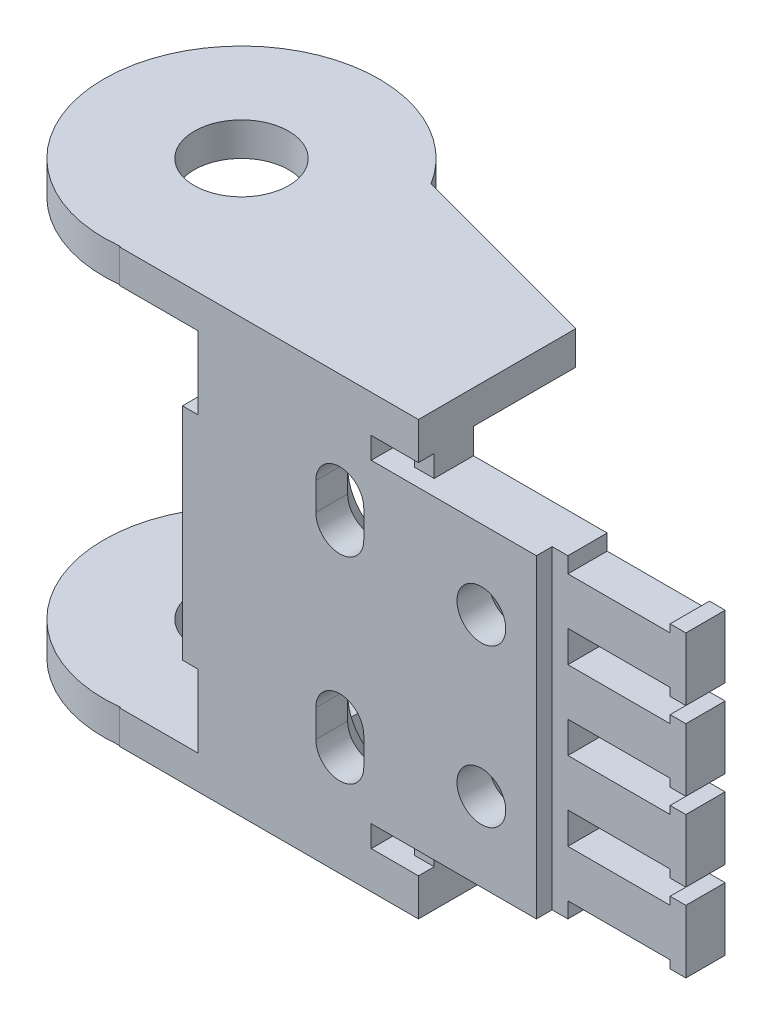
ISO-10303-21;
HEADER;
FILE_DESCRIPTION(('STEP AP214'),'2;1');
FILE_NAME('part.step','',(''),(''),'','','');
FILE_SCHEMA(('AUTOMOTIVE_DESIGN { 1 0 10303 214 1 1 1 1 }'));
ENDSEC;
DATA;
#1=APPLICATION_CONTEXT('core data for automotive mechanical design processes');
#2=APPLICATION_PROTOCOL_DEFINITION('international standard','automotive_design',2000,#1);
#3=PRODUCT_CONTEXT('',#1,'mechanical');
#4=PRODUCT('Part','Part','',(#3));
#5=PRODUCT_RELATED_PRODUCT_CATEGORY('part','',(#4));
#6=PRODUCT_DEFINITION_FORMATION('','',#4);
#7=PRODUCT_DEFINITION_CONTEXT('part definition',#1,'design');
#8=PRODUCT_DEFINITION('design','',#6,#7);
#9=PRODUCT_DEFINITION_SHAPE('','',#8);
#10=(LENGTH_UNIT() NAMED_UNIT(*) SI_UNIT(.MILLI.,.METRE.));
#11=(NAMED_UNIT(*) PLANE_ANGLE_UNIT() SI_UNIT($,.RADIAN.));
#12=(NAMED_UNIT(*) SI_UNIT($,.STERADIAN.) SOLID_ANGLE_UNIT());
#13=UNCERTAINTY_MEASURE_WITH_UNIT(LENGTH_MEASURE(1.E-05),#10,'distance_accuracy_value','');
#14=(GEOMETRIC_REPRESENTATION_CONTEXT(3) GLOBAL_UNCERTAINTY_ASSIGNED_CONTEXT((#13)) GLOBAL_UNIT_ASSIGNED_CONTEXT((#10,
#11,#12)) REPRESENTATION_CONTEXT('',''));
#15=CARTESIAN_POINT('',(0.,0.,0.));
#16=DIRECTION('',(0.,0.,1.));
#17=DIRECTION('',(1.,0.,0.));
#18=AXIS2_PLACEMENT_3D('',#15,#16,#17);
#19=CARTESIAN_POINT('',(70.,-0.999999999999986,163.));
#20=DIRECTION('',(-1.,0.,0.));
#21=DIRECTION('',(0.,0.,1.));
#22=AXIS2_PLACEMENT_3D('',#19,#20,#21);
#23=PLANE('',#22);
#24=DIRECTION('',(0.,0.,-1.));
#25=VECTOR('',#24,1.);
#26=CARTESIAN_POINT('',(70.,0.,163.));
#27=LINE('',#26,#25);
#28=CARTESIAN_POINT('',(70.,0.,165.5));
#29=VERTEX_POINT('',#28);
#30=CARTESIAN_POINT('',(70.,0.,160.5));
#31=VERTEX_POINT('',#30);
#32=EDGE_CURVE('E1026',#29,#31,#27,.T.);
#33=ORIENTED_EDGE('',*,*,#32,.F.);
#34=DIRECTION('',(0.,1.,0.));
#35=VECTOR('',#34,1.);
#36=CARTESIAN_POINT('',(70.,-0.999999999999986,165.5));
#37=LINE('',#36,#35);
#38=CARTESIAN_POINT('',(70.,1.00000000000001,165.5));
#39=VERTEX_POINT('',#38);
#40=EDGE_CURVE('E501',#29,#39,#37,.T.);
#41=ORIENTED_EDGE('',*,*,#40,.T.);
#42=DIRECTION('',(0.,0.,-1.));
#43=VECTOR('',#42,1.);
#44=CARTESIAN_POINT('',(70.,1.00000000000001,163.));
#45=LINE('',#44,#43);
#46=CARTESIAN_POINT('',(70.,1.00000000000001,160.5));
#47=VERTEX_POINT('',#46);
#48=EDGE_CURVE('E982',#47,#39,#45,.F.);
#49=ORIENTED_EDGE('',*,*,#48,.F.);
#50=DIRECTION('',(0.,1.,0.));
#51=VECTOR('',#50,1.);
#52=CARTESIAN_POINT('',(70.,-0.999999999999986,160.5));
#53=LINE('',#52,#51);
#54=EDGE_CURVE('E559',#47,#31,#53,.F.);
#55=ORIENTED_EDGE('',*,*,#54,.T.);
#56=EDGE_LOOP('',(#33,#41,#49,#55));
#57=FACE_BOUND('',#56,.T.);
#58=ADVANCED_FACE('F16',(#57),#23,.T.);
#59=CARTESIAN_POINT('',(70.,39.,163.));
#60=DIRECTION('',(-1.,0.,0.));
#61=DIRECTION('',(0.,0.,1.));
#62=AXIS2_PLACEMENT_3D('',#59,#60,#61);
#63=PLANE('',#62);
#64=DIRECTION('',(0.,0.,1.));
#65=VECTOR('',#64,1.);
#66=CARTESIAN_POINT('',(70.,38.,163.));
#67=LINE('',#66,#65);
#68=CARTESIAN_POINT('',(70.,38.,160.5));
#69=VERTEX_POINT('',#68);
#70=CARTESIAN_POINT('',(70.,38.,165.5));
#71=VERTEX_POINT('',#70);
#72=EDGE_CURVE('E509',#69,#71,#67,.T.);
#73=ORIENTED_EDGE('',*,*,#72,.F.);
#74=DIRECTION('',(0.,1.,0.));
#75=VECTOR('',#74,1.);
#76=CARTESIAN_POINT('',(70.,39.,160.5));
#77=LINE('',#76,#75);
#78=CARTESIAN_POINT('',(70.,37.,160.5));
#79=VERTEX_POINT('',#78);
#80=EDGE_CURVE('E500',#69,#79,#77,.F.);
#81=ORIENTED_EDGE('',*,*,#80,.T.);
#82=DIRECTION('',(0.,0.,1.));
#83=VECTOR('',#82,1.);
#84=CARTESIAN_POINT('',(70.,37.,163.));
#85=LINE('',#84,#83);
#86=CARTESIAN_POINT('',(70.,37.,165.5));
#87=VERTEX_POINT('',#86);
#88=EDGE_CURVE('E504',#87,#79,#85,.F.);
#89=ORIENTED_EDGE('',*,*,#88,.F.);
#90=DIRECTION('',(0.,1.,0.));
#91=VECTOR('',#90,1.);
#92=CARTESIAN_POINT('',(70.,39.,165.5));
#93=LINE('',#92,#91);
#94=EDGE_CURVE('E487',#87,#71,#93,.T.);
#95=ORIENTED_EDGE('',*,*,#94,.T.);
#96=EDGE_LOOP('',(#73,#81,#89,#95));
#97=FACE_BOUND('',#96,.T.);
#98=ADVANCED_FACE('F505',(#97),#63,.T.);
#99=CARTESIAN_POINT('',(70.,29.,163.));
#100=DIRECTION('',(-1.,0.,0.));
#101=DIRECTION('',(0.,0.,1.));
#102=AXIS2_PLACEMENT_3D('',#99,#100,#101);
#103=PLANE('',#102);
#104=DIRECTION('',(0.,0.,-1.));
#105=VECTOR('',#104,1.);
#106=CARTESIAN_POINT('',(70.,30.,163.));
#107=LINE('',#106,#105);
#108=CARTESIAN_POINT('',(70.,30.,165.5));
#109=VERTEX_POINT('',#108);
#110=CARTESIAN_POINT('',(70.,30.,160.5));
#111=VERTEX_POINT('',#110);
#112=EDGE_CURVE('E963',#109,#111,#107,.T.);
#113=ORIENTED_EDGE('',*,*,#112,.F.);
#114=DIRECTION('',(0.,1.,0.));
#115=VECTOR('',#114,1.);
#116=CARTESIAN_POINT('',(70.,29.,165.5));
#117=LINE('',#116,#115);
#118=CARTESIAN_POINT('',(70.,31.,165.5));
#119=VERTEX_POINT('',#118);
#120=EDGE_CURVE('E549',#109,#119,#117,.T.);
#121=ORIENTED_EDGE('',*,*,#120,.T.);
#122=DIRECTION('',(0.,0.,-1.));
#123=VECTOR('',#122,1.);
#124=CARTESIAN_POINT('',(70.,31.,163.));
#125=LINE('',#124,#123);
#126=CARTESIAN_POINT('',(70.,31.,160.5));
#127=VERTEX_POINT('',#126);
#128=EDGE_CURVE('E958',#127,#119,#125,.F.);
#129=ORIENTED_EDGE('',*,*,#128,.F.);
#130=DIRECTION('',(0.,1.,0.));
#131=VECTOR('',#130,1.);
#132=CARTESIAN_POINT('',(70.,29.,160.5));
#133=LINE('',#132,#131);
#134=EDGE_CURVE('E551',#127,#111,#133,.F.);
#135=ORIENTED_EDGE('',*,*,#134,.T.);
#136=EDGE_LOOP('',(#113,#121,#129,#135));
#137=FACE_BOUND('',#136,.T.);
#138=ADVANCED_FACE('F1847',(#137),#103,.T.);
#139=CARTESIAN_POINT('',(70.,29.,163.));
#140=DIRECTION('',(-1.,0.,0.));
#141=DIRECTION('',(0.,0.,1.));
#142=AXIS2_PLACEMENT_3D('',#139,#140,#141);
#143=PLANE('',#142);
#144=DIRECTION('',(0.,0.,1.));
#145=VECTOR('',#144,1.);
#146=CARTESIAN_POINT('',(70.,28.,163.));
#147=LINE('',#146,#145);
#148=CARTESIAN_POINT('',(70.,28.,160.5));
#149=VERTEX_POINT('',#148);
#150=CARTESIAN_POINT('',(70.,28.,165.5));
#151=VERTEX_POINT('',#150);
#152=EDGE_CURVE('E948',#149,#151,#147,.T.);
#153=ORIENTED_EDGE('',*,*,#152,.F.);
#154=DIRECTION('',(0.,1.,0.));
#155=VECTOR('',#154,1.);
#156=CARTESIAN_POINT('',(70.,29.,160.5));
#157=LINE('',#156,#155);
#158=CARTESIAN_POINT('',(70.,27.,160.5));
#159=VERTEX_POINT('',#158);
#160=EDGE_CURVE('E545',#149,#159,#157,.F.);
#161=ORIENTED_EDGE('',*,*,#160,.T.);
#162=DIRECTION('',(0.,0.,1.));
#163=VECTOR('',#162,1.);
#164=CARTESIAN_POINT('',(70.,27.,163.));
#165=LINE('',#164,#163);
#166=CARTESIAN_POINT('',(70.,27.,165.5));
#167=VERTEX_POINT('',#166);
#168=EDGE_CURVE('E953',#167,#159,#165,.F.);
#169=ORIENTED_EDGE('',*,*,#168,.F.);
#170=DIRECTION('',(0.,1.,0.));
#171=VECTOR('',#170,1.);
#172=CARTESIAN_POINT('',(70.,29.,165.5));
#173=LINE('',#172,#171);
#174=EDGE_CURVE('E547',#167,#151,#173,.T.);
#175=ORIENTED_EDGE('',*,*,#174,.T.);
#176=EDGE_LOOP('',(#153,#161,#169,#175));
#177=FACE_BOUND('',#176,.T.);
#178=ADVANCED_FACE('F1843',(#177),#143,.T.);
#179=CARTESIAN_POINT('',(70.,19.,163.));
#180=DIRECTION('',(-1.,0.,0.));
#181=DIRECTION('',(0.,0.,1.));
#182=AXIS2_PLACEMENT_3D('',#179,#180,#181);
#183=PLANE('',#182);
#184=DIRECTION('',(0.,0.,-1.));
#185=VECTOR('',#184,1.);
#186=CARTESIAN_POINT('',(70.,20.,163.));
#187=LINE('',#186,#185);
#188=CARTESIAN_POINT('',(70.,20.,165.5));
#189=VERTEX_POINT('',#188);
#190=CARTESIAN_POINT('',(70.,20.,160.5));
#191=VERTEX_POINT('',#190);
#192=EDGE_CURVE('E943',#189,#191,#187,.T.);
#193=ORIENTED_EDGE('',*,*,#192,.F.);
#194=DIRECTION('',(0.,1.,0.));
#195=VECTOR('',#194,1.);
#196=CARTESIAN_POINT('',(70.,19.,165.5));
#197=LINE('',#196,#195);
#198=CARTESIAN_POINT('',(70.,21.,165.5));
#199=VERTEX_POINT('',#198);
#200=EDGE_CURVE('E541',#189,#199,#197,.T.);
#201=ORIENTED_EDGE('',*,*,#200,.T.);
#202=DIRECTION('',(0.,0.,-1.));
#203=VECTOR('',#202,1.);
#204=CARTESIAN_POINT('',(70.,21.,163.));
#205=LINE('',#204,#203);
#206=CARTESIAN_POINT('',(70.,21.,160.5));
#207=VERTEX_POINT('',#206);
#208=EDGE_CURVE('E938',#207,#199,#205,.F.);
#209=ORIENTED_EDGE('',*,*,#208,.F.);
#210=DIRECTION('',(0.,1.,0.));
#211=VECTOR('',#210,1.);
#212=CARTESIAN_POINT('',(70.,19.,160.5));
#213=LINE('',#212,#211);
#214=EDGE_CURVE('E543',#207,#191,#213,.F.);
#215=ORIENTED_EDGE('',*,*,#214,.T.);
#216=EDGE_LOOP('',(#193,#201,#209,#215));
#217=FACE_BOUND('',#216,.T.);
#218=ADVANCED_FACE('F1839',(#217),#183,.T.);
#219=CARTESIAN_POINT('',(70.,19.,163.));
#220=DIRECTION('',(-1.,0.,0.));
#221=DIRECTION('',(0.,0.,1.));
#222=AXIS2_PLACEMENT_3D('',#219,#220,#221);
#223=PLANE('',#222);
#224=DIRECTION('',(0.,0.,1.));
#225=VECTOR('',#224,1.);
#226=CARTESIAN_POINT('',(70.,18.,163.));
#227=LINE('',#226,#225);
#228=CARTESIAN_POINT('',(70.,18.,160.5));
#229=VERTEX_POINT('',#228);
#230=CARTESIAN_POINT('',(70.,18.,165.5));
#231=VERTEX_POINT('',#230);
#232=EDGE_CURVE('E928',#229,#231,#227,.T.);
#233=ORIENTED_EDGE('',*,*,#232,.F.);
#234=DIRECTION('',(0.,1.,0.));
#235=VECTOR('',#234,1.);
#236=CARTESIAN_POINT('',(70.,19.,160.5));
#237=LINE('',#236,#235);
#238=CARTESIAN_POINT('',(70.,17.,160.5));
#239=VERTEX_POINT('',#238);
#240=EDGE_CURVE('E537',#229,#239,#237,.F.);
#241=ORIENTED_EDGE('',*,*,#240,.T.);
#242=DIRECTION('',(0.,0.,1.));
#243=VECTOR('',#242,1.);
#244=CARTESIAN_POINT('',(70.,17.,163.));
#245=LINE('',#244,#243);
#246=CARTESIAN_POINT('',(70.,17.,165.5));
#247=VERTEX_POINT('',#246);
#248=EDGE_CURVE('E933',#247,#239,#245,.F.);
#249=ORIENTED_EDGE('',*,*,#248,.F.);
#250=DIRECTION('',(0.,1.,0.));
#251=VECTOR('',#250,1.);
#252=CARTESIAN_POINT('',(70.,19.,165.5));
#253=LINE('',#252,#251);
#254=EDGE_CURVE('E539',#247,#231,#253,.T.);
#255=ORIENTED_EDGE('',*,*,#254,.T.);
#256=EDGE_LOOP('',(#233,#241,#249,#255));
#257=FACE_BOUND('',#256,.T.);
#258=ADVANCED_FACE('F1835',(#257),#223,.T.);
#259=CARTESIAN_POINT('',(70.,9.00000000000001,163.));
#260=DIRECTION('',(-1.,0.,0.));
#261=DIRECTION('',(0.,0.,1.));
#262=AXIS2_PLACEMENT_3D('',#259,#260,#261);
#263=PLANE('',#262);
#264=DIRECTION('',(0.,0.,-1.));
#265=VECTOR('',#264,1.);
#266=CARTESIAN_POINT('',(70.,10.,163.));
#267=LINE('',#266,#265);
#268=CARTESIAN_POINT('',(70.,10.,165.5));
#269=VERTEX_POINT('',#268);
#270=CARTESIAN_POINT('',(70.,10.,160.5));
#271=VERTEX_POINT('',#270);
#272=EDGE_CURVE('E923',#269,#271,#267,.T.);
#273=ORIENTED_EDGE('',*,*,#272,.F.);
#274=DIRECTION('',(0.,1.,0.));
#275=VECTOR('',#274,1.);
#276=CARTESIAN_POINT('',(70.,9.00000000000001,165.5));
#277=LINE('',#276,#275);
#278=CARTESIAN_POINT('',(70.,11.,165.5));
#279=VERTEX_POINT('',#278);
#280=EDGE_CURVE('E533',#269,#279,#277,.T.);
#281=ORIENTED_EDGE('',*,*,#280,.T.);
#282=DIRECTION('',(0.,0.,-1.));
#283=VECTOR('',#282,1.);
#284=CARTESIAN_POINT('',(70.,11.,163.));
#285=LINE('',#284,#283);
#286=CARTESIAN_POINT('',(70.,11.,160.5));
#287=VERTEX_POINT('',#286);
#288=EDGE_CURVE('E918',#287,#279,#285,.F.);
#289=ORIENTED_EDGE('',*,*,#288,.F.);
#290=DIRECTION('',(0.,1.,0.));
#291=VECTOR('',#290,1.);
#292=CARTESIAN_POINT('',(70.,9.00000000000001,160.5));
#293=LINE('',#292,#291);
#294=EDGE_CURVE('E535',#287,#271,#293,.F.);
#295=ORIENTED_EDGE('',*,*,#294,.T.);
#296=EDGE_LOOP('',(#273,#281,#289,#295));
#297=FACE_BOUND('',#296,.T.);
#298=ADVANCED_FACE('F1832',(#297),#263,.T.);
#299=CARTESIAN_POINT('',(70.,9.00000000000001,163.));
#300=DIRECTION('',(-1.,0.,0.));
#301=DIRECTION('',(0.,0.,1.));
#302=AXIS2_PLACEMENT_3D('',#299,#300,#301);
#303=PLANE('',#302);
#304=DIRECTION('',(0.,0.,1.));
#305=VECTOR('',#304,1.);
#306=CARTESIAN_POINT('',(70.,8.00000000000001,163.));
#307=LINE('',#306,#305);
#308=CARTESIAN_POINT('',(70.,8.00000000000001,160.5));
#309=VERTEX_POINT('',#308);
#310=CARTESIAN_POINT('',(70.,8.00000000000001,165.5));
#311=VERTEX_POINT('',#310);
#312=EDGE_CURVE('E530',#309,#311,#307,.T.);
#313=ORIENTED_EDGE('',*,*,#312,.F.);
#314=DIRECTION('',(0.,1.,0.));
#315=VECTOR('',#314,1.);
#316=CARTESIAN_POINT('',(70.,9.00000000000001,160.5));
#317=LINE('',#316,#315);
#318=CARTESIAN_POINT('',(70.,7.00000000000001,160.5));
#319=VERTEX_POINT('',#318);
#320=EDGE_CURVE('E163',#309,#319,#317,.F.);
#321=ORIENTED_EDGE('',*,*,#320,.T.);
#322=DIRECTION('',(0.,0.,1.));
#323=VECTOR('',#322,1.);
#324=CARTESIAN_POINT('',(70.,7.00000000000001,163.));
#325=LINE('',#324,#323);
#326=CARTESIAN_POINT('',(70.,7.00000000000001,165.5));
#327=VERTEX_POINT('',#326);
#328=EDGE_CURVE('E914',#327,#319,#325,.F.);
#329=ORIENTED_EDGE('',*,*,#328,.F.);
#330=DIRECTION('',(0.,1.,0.));
#331=VECTOR('',#330,1.);
#332=CARTESIAN_POINT('',(70.,9.00000000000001,165.5));
#333=LINE('',#332,#331);
#334=EDGE_CURVE('E531',#327,#311,#333,.T.);
#335=ORIENTED_EDGE('',*,*,#334,.T.);
#336=EDGE_LOOP('',(#313,#321,#329,#335));
#337=FACE_BOUND('',#336,.T.);
#338=ADVANCED_FACE('F1828',(#337),#303,.T.);
#339=CARTESIAN_POINT('',(71.,8.00000000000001,163.));
#340=DIRECTION('',(0.,1.,0.));
#341=DIRECTION('',(0.,0.,1.));
#342=AXIS2_PLACEMENT_3D('',#339,#340,#341);
#343=PLANE('',#342);
#344=ORIENTED_EDGE('',*,*,#312,.T.);
#345=DIRECTION('',(1.,0.,0.));
#346=VECTOR('',#345,1.);
#347=CARTESIAN_POINT('',(55.,8.00000000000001,165.5));
#348=LINE('',#347,#346);
#349=CARTESIAN_POINT('',(72.,8.00000000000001,165.5));
#350=VERTEX_POINT('',#349);
#351=EDGE_CURVE('E869',#350,#311,#348,.F.);
#352=ORIENTED_EDGE('',*,*,#351,.F.);
#353=DIRECTION('',(0.,0.,-1.));
#354=VECTOR('',#353,1.);
#355=CARTESIAN_POINT('',(72.,8.00000000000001,165.5));
#356=LINE('',#355,#354);
#357=CARTESIAN_POINT('',(72.,8.00000000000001,160.5));
#358=VERTEX_POINT('',#357);
#359=EDGE_CURVE('E1029',#358,#350,#356,.F.);
#360=ORIENTED_EDGE('',*,*,#359,.F.);
#361=DIRECTION('',(-1.,0.,0.));
#362=VECTOR('',#361,1.);
#363=CARTESIAN_POINT('',(72.,8.00000000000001,160.5));
#364=LINE('',#363,#362);
#365=EDGE_CURVE('E1009',#309,#358,#364,.F.);
#366=ORIENTED_EDGE('',*,*,#365,.F.);
#367=EDGE_LOOP('',(#344,#352,#360,#366));
#368=FACE_BOUND('',#367,.T.);
#369=ADVANCED_FACE('F1824',(#368),#343,.T.);
#370=CARTESIAN_POINT('',(72.,39.,165.5));
#371=DIRECTION('',(1.,0.,0.));
#372=DIRECTION('',(0.,0.,-1.));
#373=AXIS2_PLACEMENT_3D('',#370,#371,#372);
#374=PLANE('',#373);
#375=DIRECTION('',(0.,0.,-1.));
#376=VECTOR('',#375,1.);
#377=CARTESIAN_POINT('',(72.,0.,163.));
#378=LINE('',#377,#376);
#379=CARTESIAN_POINT('',(72.,0.,160.5));
#380=VERTEX_POINT('',#379);
#381=CARTESIAN_POINT('',(72.,0.,165.5));
#382=VERTEX_POINT('',#381);
#383=EDGE_CURVE('E1024',#380,#382,#378,.F.);
#384=ORIENTED_EDGE('',*,*,#383,.F.);
#385=DIRECTION('',(0.,1.,0.));
#386=VECTOR('',#385,1.);
#387=CARTESIAN_POINT('',(72.,39.,160.5));
#388=LINE('',#387,#386);
#389=EDGE_CURVE('E1217',#358,#380,#388,.F.);
#390=ORIENTED_EDGE('',*,*,#389,.F.);
#391=ORIENTED_EDGE('',*,*,#359,.T.);
#392=DIRECTION('',(0.,1.,0.));
#393=VECTOR('',#392,1.);
#394=CARTESIAN_POINT('',(72.,39.,165.5));
#395=LINE('',#394,#393);
#396=EDGE_CURVE('E872',#382,#350,#395,.T.);
#397=ORIENTED_EDGE('',*,*,#396,.F.);
#398=EDGE_LOOP('',(#384,#390,#391,#397));
#399=FACE_BOUND('',#398,.T.);
#400=ADVANCED_FACE('F1820',(#399),#374,.T.);
#401=CARTESIAN_POINT('',(71.,0.,163.));
#402=DIRECTION('',(0.,-1.,0.));
#403=DIRECTION('',(0.,0.,-1.));
#404=AXIS2_PLACEMENT_3D('',#401,#402,#403);
#405=PLANE('',#404);
#406=ORIENTED_EDGE('',*,*,#383,.T.);
#407=DIRECTION('',(1.,0.,0.));
#408=VECTOR('',#407,1.);
#409=CARTESIAN_POINT('',(55.,0.,165.5));
#410=LINE('',#409,#408);
#411=EDGE_CURVE('E875',#29,#382,#410,.T.);
#412=ORIENTED_EDGE('',*,*,#411,.F.);
#413=ORIENTED_EDGE('',*,*,#32,.T.);
#414=DIRECTION('',(-1.,0.,0.));
#415=VECTOR('',#414,1.);
#416=CARTESIAN_POINT('',(72.,0.,160.5));
#417=LINE('',#416,#415);
#418=EDGE_CURVE('E1214',#380,#31,#417,.T.);
#419=ORIENTED_EDGE('',*,*,#418,.F.);
#420=EDGE_LOOP('',(#406,#412,#413,#419));
#421=FACE_BOUND('',#420,.T.);
#422=ADVANCED_FACE('F1816',(#421),#405,.T.);
#423=CARTESIAN_POINT('',(63.5,1.00000000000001,163.));
#424=DIRECTION('',(0.,-1.,0.));
#425=DIRECTION('',(0.,0.,-1.));
#426=AXIS2_PLACEMENT_3D('',#423,#424,#425);
#427=PLANE('',#426);
#428=ORIENTED_EDGE('',*,*,#48,.T.);
#429=DIRECTION('',(1.,0.,0.));
#430=VECTOR('',#429,1.);
#431=CARTESIAN_POINT('',(55.,1.00000000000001,165.5));
#432=LINE('',#431,#430);
#433=CARTESIAN_POINT('',(57.,1.00000000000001,165.5));
#434=VERTEX_POINT('',#433);
#435=EDGE_CURVE('E878',#434,#39,#432,.T.);
#436=ORIENTED_EDGE('',*,*,#435,.F.);
#437=DIRECTION('',(0.,0.,-1.));
#438=VECTOR('',#437,1.);
#439=CARTESIAN_POINT('',(57.,1.00000000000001,163.));
#440=LINE('',#439,#438);
#441=CARTESIAN_POINT('',(57.,1.00000000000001,160.5));
#442=VERTEX_POINT('',#441);
#443=EDGE_CURVE('E887',#442,#434,#440,.F.);
#444=ORIENTED_EDGE('',*,*,#443,.F.);
#445=DIRECTION('',(-1.,0.,0.));
#446=VECTOR('',#445,1.);
#447=CARTESIAN_POINT('',(72.,1.00000000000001,160.5));
#448=LINE('',#447,#446);
#449=EDGE_CURVE('E1211',#47,#442,#448,.T.);
#450=ORIENTED_EDGE('',*,*,#449,.F.);
#451=EDGE_LOOP('',(#428,#436,#444,#450));
#452=FACE_BOUND('',#451,.T.);
#453=ADVANCED_FACE('F1813',(#452),#427,.T.);
#454=CARTESIAN_POINT('',(11.25,38.,150.));
#455=DIRECTION('',(0.,1.,0.));
#456=DIRECTION('',(0.,0.,1.));
#457=AXIS2_PLACEMENT_3D('',#454,#455,#456);
#458=PLANE('',#457);
#459=CARTESIAN_POINT('',(0.,38.,150.));
#460=DIRECTION('',(0.,1.,0.));
#461=DIRECTION('',(0.,0.,1.));
#462=AXIS2_PLACEMENT_3D('',#459,#460,#461);
#463=CIRCLE('',#462,17.7);
#464=CARTESIAN_POINT('',(14.2492105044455,38.,160.5));
#465=VERTEX_POINT('',#464);
#466=CARTESIAN_POINT('',(15.1456155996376,38.,140.84028777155));
#467=VERTEX_POINT('',#466);
#468=EDGE_CURVE('E661',#465,#467,#463,.T.);
#469=ORIENTED_EDGE('',*,*,#468,.T.);
#470=DIRECTION('',(-0.965925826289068,0.,-0.258819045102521));
#471=VECTOR('',#470,1.);
#472=CARTESIAN_POINT('',(40.,38.,147.5));
#473=LINE('',#472,#471);
#474=CARTESIAN_POINT('',(22.,38.,142.67691453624));
#475=VERTEX_POINT('',#474);
#476=EDGE_CURVE('E679',#475,#467,#473,.T.);
#477=ORIENTED_EDGE('',*,*,#476,.F.);
#478=DIRECTION('',(0.,0.,-1.));
#479=VECTOR('',#478,1.);
#480=CARTESIAN_POINT('',(22.,38.,143.));
#481=LINE('',#480,#479);
#482=CARTESIAN_POINT('',(22.,38.,160.5));
#483=VERTEX_POINT('',#482);
#484=EDGE_CURVE('E510',#483,#475,#481,.T.);
#485=ORIENTED_EDGE('',*,*,#484,.F.);
#486=DIRECTION('',(-1.,0.,0.));
#487=VECTOR('',#486,1.);
#488=CARTESIAN_POINT('',(72.,38.,160.5));
#489=LINE('',#488,#487);
#490=EDGE_CURVE('E978',#465,#483,#489,.F.);
#491=ORIENTED_EDGE('',*,*,#490,.F.);
#492=EDGE_LOOP('',(#469,#477,#485,#491));
#493=FACE_BOUND('',#492,.T.);
#494=ADVANCED_FACE('F1809',(#493),#458,.F.);
#495=CARTESIAN_POINT('',(22.,19.,143.));
#496=DIRECTION('',(1.,0.,0.));
#497=DIRECTION('',(0.,0.,-1.));
#498=AXIS2_PLACEMENT_3D('',#495,#496,#497);
#499=PLANE('',#498);
#500=DIRECTION('',(0.,1.,0.));
#501=VECTOR('',#500,1.);
#502=CARTESIAN_POINT('',(22.,46.5,142.67691453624));
#503=LINE('',#502,#501);
#504=CARTESIAN_POINT('',(22.,42.25,142.67691453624));
#505=VERTEX_POINT('',#504);
#506=EDGE_CURVE('E714',#505,#475,#503,.F.);
#507=ORIENTED_EDGE('',*,*,#506,.F.);
#508=DIRECTION('',(0.,0.,1.));
#509=VECTOR('',#508,1.);
#510=CARTESIAN_POINT('',(22.,42.25,143.));
#511=LINE('',#510,#509);
#512=CARTESIAN_POINT('',(22.,42.25,160.5));
#513=VERTEX_POINT('',#512);
#514=EDGE_CURVE('E715',#505,#513,#511,.T.);
#515=ORIENTED_EDGE('',*,*,#514,.T.);
#516=DIRECTION('',(0.,1.,0.));
#517=VECTOR('',#516,1.);
#518=CARTESIAN_POINT('',(22.,39.,160.5));
#519=LINE('',#518,#517);
#520=EDGE_CURVE('E731',#483,#513,#519,.T.);
#521=ORIENTED_EDGE('',*,*,#520,.F.);
#522=ORIENTED_EDGE('',*,*,#484,.T.);
#523=EDGE_LOOP('',(#507,#515,#521,#522));
#524=FACE_BOUND('',#523,.T.);
#525=ADVANCED_FACE('F1806',(#524),#499,.T.);
#526=CARTESIAN_POINT('',(63.5,37.,163.));
#527=DIRECTION('',(0.,1.,0.));
#528=DIRECTION('',(0.,0.,1.));
#529=AXIS2_PLACEMENT_3D('',#526,#527,#528);
#530=PLANE('',#529);
#531=DIRECTION('',(0.,0.,-1.));
#532=VECTOR('',#531,1.);
#533=CARTESIAN_POINT('',(57.,37.,163.));
#534=LINE('',#533,#532);
#535=CARTESIAN_POINT('',(57.,37.,165.5));
#536=VERTEX_POINT('',#535);
#537=CARTESIAN_POINT('',(57.,37.,160.5));
#538=VERTEX_POINT('',#537);
#539=EDGE_CURVE('E513',#536,#538,#534,.T.);
#540=ORIENTED_EDGE('',*,*,#539,.F.);
#541=DIRECTION('',(1.,0.,0.));
#542=VECTOR('',#541,1.);
#543=CARTESIAN_POINT('',(55.,37.,165.5));
#544=LINE('',#543,#542);
#545=EDGE_CURVE('E496',#87,#536,#544,.F.);
#546=ORIENTED_EDGE('',*,*,#545,.F.);
#547=ORIENTED_EDGE('',*,*,#88,.T.);
#548=DIRECTION('',(-1.,0.,0.));
#549=VECTOR('',#548,1.);
#550=CARTESIAN_POINT('',(72.,37.,160.5));
#551=LINE('',#550,#549);
#552=EDGE_CURVE('E569',#538,#79,#551,.F.);
#553=ORIENTED_EDGE('',*,*,#552,.F.);
#554=EDGE_LOOP('',(#540,#546,#547,#553));
#555=FACE_BOUND('',#554,.T.);
#556=ADVANCED_FACE('F512',(#555),#530,.T.);
#557=CARTESIAN_POINT('',(71.,38.,163.));
#558=DIRECTION('',(0.,1.,0.));
#559=DIRECTION('',(0.,0.,1.));
#560=AXIS2_PLACEMENT_3D('',#557,#558,#559);
#561=PLANE('',#560);
#562=ORIENTED_EDGE('',*,*,#72,.T.);
#563=DIRECTION('',(1.,0.,0.));
#564=VECTOR('',#563,1.);
#565=CARTESIAN_POINT('',(55.,38.,165.5));
#566=LINE('',#565,#564);
#567=CARTESIAN_POINT('',(72.,38.,165.5));
#568=VERTEX_POINT('',#567);
#569=EDGE_CURVE('E499',#568,#71,#566,.F.);
#570=ORIENTED_EDGE('',*,*,#569,.F.);
#571=DIRECTION('',(0.,0.,-1.));
#572=VECTOR('',#571,1.);
#573=CARTESIAN_POINT('',(72.,38.,165.5));
#574=LINE('',#573,#572);
#575=CARTESIAN_POINT('',(72.,38.,160.5));
#576=VERTEX_POINT('',#575);
#577=EDGE_CURVE('E562',#576,#568,#574,.F.);
#578=ORIENTED_EDGE('',*,*,#577,.F.);
#579=DIRECTION('',(-1.,0.,0.));
#580=VECTOR('',#579,1.);
#581=CARTESIAN_POINT('',(72.,38.,160.5));
#582=LINE('',#581,#580);
#583=EDGE_CURVE('E565',#69,#576,#582,.F.);
#584=ORIENTED_EDGE('',*,*,#583,.F.);
#585=EDGE_LOOP('',(#562,#570,#578,#584));
#586=FACE_BOUND('',#585,.T.);
#587=ADVANCED_FACE('F1799',(#586),#561,.T.);
#588=CARTESIAN_POINT('',(72.,39.,165.5));
#589=DIRECTION('',(1.,0.,0.));
#590=DIRECTION('',(0.,0.,-1.));
#591=AXIS2_PLACEMENT_3D('',#588,#589,#590);
#592=PLANE('',#591);
#593=DIRECTION('',(0.,0.,-1.));
#594=VECTOR('',#593,1.);
#595=CARTESIAN_POINT('',(72.,30.,163.));
#596=LINE('',#595,#594);
#597=CARTESIAN_POINT('',(72.,30.,160.5));
#598=VERTEX_POINT('',#597);
#599=CARTESIAN_POINT('',(72.,30.,165.5));
#600=VERTEX_POINT('',#599);
#601=EDGE_CURVE('E961',#598,#600,#596,.F.);
#602=ORIENTED_EDGE('',*,*,#601,.F.);
#603=DIRECTION('',(0.,1.,0.));
#604=VECTOR('',#603,1.);
#605=CARTESIAN_POINT('',(72.,39.,160.5));
#606=LINE('',#605,#604);
#607=EDGE_CURVE('E568',#576,#598,#606,.F.);
#608=ORIENTED_EDGE('',*,*,#607,.F.);
#609=ORIENTED_EDGE('',*,*,#577,.T.);
#610=DIRECTION('',(0.,1.,0.));
#611=VECTOR('',#610,1.);
#612=CARTESIAN_POINT('',(72.,39.,165.5));
#613=LINE('',#612,#611);
#614=EDGE_CURVE('E519',#600,#568,#613,.T.);
#615=ORIENTED_EDGE('',*,*,#614,.F.);
#616=EDGE_LOOP('',(#602,#608,#609,#615));
#617=FACE_BOUND('',#616,.T.);
#618=ADVANCED_FACE('F1795',(#617),#592,.T.);
#619=CARTESIAN_POINT('',(71.,30.,163.));
#620=DIRECTION('',(0.,-1.,0.));
#621=DIRECTION('',(0.,0.,-1.));
#622=AXIS2_PLACEMENT_3D('',#619,#620,#621);
#623=PLANE('',#622);
#624=ORIENTED_EDGE('',*,*,#601,.T.);
#625=DIRECTION('',(1.,0.,0.));
#626=VECTOR('',#625,1.);
#627=CARTESIAN_POINT('',(55.,30.,165.5));
#628=LINE('',#627,#626);
#629=EDGE_CURVE('E821',#109,#600,#628,.T.);
#630=ORIENTED_EDGE('',*,*,#629,.F.);
#631=ORIENTED_EDGE('',*,*,#112,.T.);
#632=DIRECTION('',(-1.,0.,0.));
#633=VECTOR('',#632,1.);
#634=CARTESIAN_POINT('',(72.,30.,160.5));
#635=LINE('',#634,#633);
#636=EDGE_CURVE('E1204',#598,#111,#635,.T.);
#637=ORIENTED_EDGE('',*,*,#636,.F.);
#638=EDGE_LOOP('',(#624,#630,#631,#637));
#639=FACE_BOUND('',#638,.T.);
#640=ADVANCED_FACE('F1791',(#639),#623,.T.);
#641=CARTESIAN_POINT('',(63.5,31.,163.));
#642=DIRECTION('',(0.,-1.,0.));
#643=DIRECTION('',(0.,0.,-1.));
#644=AXIS2_PLACEMENT_3D('',#641,#642,#643);
#645=PLANE('',#644);
#646=ORIENTED_EDGE('',*,*,#128,.T.);
#647=DIRECTION('',(1.,0.,0.));
#648=VECTOR('',#647,1.);
#649=CARTESIAN_POINT('',(55.,31.,165.5));
#650=LINE('',#649,#648);
#651=CARTESIAN_POINT('',(57.,31.,165.5));
#652=VERTEX_POINT('',#651);
#653=EDGE_CURVE('E824',#652,#119,#650,.T.);
#654=ORIENTED_EDGE('',*,*,#653,.F.);
#655=DIRECTION('',(0.,0.,-1.));
#656=VECTOR('',#655,1.);
#657=CARTESIAN_POINT('',(57.,31.,163.));
#658=LINE('',#657,#656);
#659=CARTESIAN_POINT('',(57.,31.,160.5));
#660=VERTEX_POINT('',#659);
#661=EDGE_CURVE('E956',#660,#652,#658,.F.);
#662=ORIENTED_EDGE('',*,*,#661,.F.);
#663=DIRECTION('',(-1.,0.,0.));
#664=VECTOR('',#663,1.);
#665=CARTESIAN_POINT('',(72.,31.,160.5));
#666=LINE('',#665,#664);
#667=EDGE_CURVE('E1201',#127,#660,#666,.T.);
#668=ORIENTED_EDGE('',*,*,#667,.F.);
#669=EDGE_LOOP('',(#646,#654,#662,#668));
#670=FACE_BOUND('',#669,.T.);
#671=ADVANCED_FACE('F1787',(#670),#645,.T.);
#672=CARTESIAN_POINT('',(57.,29.,163.));
#673=DIRECTION('',(1.,0.,0.));
#674=DIRECTION('',(0.,0.,-1.));
#675=AXIS2_PLACEMENT_3D('',#672,#673,#674);
#676=PLANE('',#675);
#677=ORIENTED_EDGE('',*,*,#661,.T.);
#678=DIRECTION('',(0.,1.,0.));
#679=VECTOR('',#678,1.);
#680=CARTESIAN_POINT('',(57.,39.,165.5));
#681=LINE('',#680,#679);
#682=CARTESIAN_POINT('',(57.,27.,165.5));
#683=VERTEX_POINT('',#682);
#684=EDGE_CURVE('E827',#683,#652,#681,.T.);
#685=ORIENTED_EDGE('',*,*,#684,.F.);
#686=DIRECTION('',(0.,0.,1.));
#687=VECTOR('',#686,1.);
#688=CARTESIAN_POINT('',(57.,27.,163.));
#689=LINE('',#688,#687);
#690=CARTESIAN_POINT('',(57.,27.,160.5));
#691=VERTEX_POINT('',#690);
#692=EDGE_CURVE('E951',#691,#683,#689,.T.);
#693=ORIENTED_EDGE('',*,*,#692,.F.);
#694=DIRECTION('',(0.,1.,0.));
#695=VECTOR('',#694,1.);
#696=CARTESIAN_POINT('',(57.,39.,160.5));
#697=LINE('',#696,#695);
#698=EDGE_CURVE('E1198',#660,#691,#697,.F.);
#699=ORIENTED_EDGE('',*,*,#698,.F.);
#700=EDGE_LOOP('',(#677,#685,#693,#699));
#701=FACE_BOUND('',#700,.T.);
#702=ADVANCED_FACE('F1783',(#701),#676,.T.);
#703=CARTESIAN_POINT('',(63.5,27.,163.));
#704=DIRECTION('',(0.,1.,0.));
#705=DIRECTION('',(0.,0.,1.));
#706=AXIS2_PLACEMENT_3D('',#703,#704,#705);
#707=PLANE('',#706);
#708=ORIENTED_EDGE('',*,*,#692,.T.);
#709=DIRECTION('',(1.,0.,0.));
#710=VECTOR('',#709,1.);
#711=CARTESIAN_POINT('',(55.,27.,165.5));
#712=LINE('',#711,#710);
#713=EDGE_CURVE('E830',#167,#683,#712,.F.);
#714=ORIENTED_EDGE('',*,*,#713,.F.);
#715=ORIENTED_EDGE('',*,*,#168,.T.);
#716=DIRECTION('',(-1.,0.,0.));
#717=VECTOR('',#716,1.);
#718=CARTESIAN_POINT('',(72.,27.,160.5));
#719=LINE('',#718,#717);
#720=EDGE_CURVE('E1195',#691,#159,#719,.F.);
#721=ORIENTED_EDGE('',*,*,#720,.F.);
#722=EDGE_LOOP('',(#708,#714,#715,#721));
#723=FACE_BOUND('',#722,.T.);
#724=ADVANCED_FACE('F1779',(#723),#707,.T.);
#725=CARTESIAN_POINT('',(71.,28.,163.));
#726=DIRECTION('',(0.,1.,0.));
#727=DIRECTION('',(0.,0.,1.));
#728=AXIS2_PLACEMENT_3D('',#725,#726,#727);
#729=PLANE('',#728);
#730=ORIENTED_EDGE('',*,*,#152,.T.);
#731=DIRECTION('',(1.,0.,0.));
#732=VECTOR('',#731,1.);
#733=CARTESIAN_POINT('',(55.,28.,165.5));
#734=LINE('',#733,#732);
#735=CARTESIAN_POINT('',(72.,28.,165.5));
#736=VERTEX_POINT('',#735);
#737=EDGE_CURVE('E833',#736,#151,#734,.F.);
#738=ORIENTED_EDGE('',*,*,#737,.F.);
#739=DIRECTION('',(0.,0.,-1.));
#740=VECTOR('',#739,1.);
#741=CARTESIAN_POINT('',(72.,28.,165.5));
#742=LINE('',#741,#740);
#743=CARTESIAN_POINT('',(72.,28.,160.5));
#744=VERTEX_POINT('',#743);
#745=EDGE_CURVE('E946',#744,#736,#742,.F.);
#746=ORIENTED_EDGE('',*,*,#745,.F.);
#747=DIRECTION('',(-1.,0.,0.));
#748=VECTOR('',#747,1.);
#749=CARTESIAN_POINT('',(72.,28.,160.5));
#750=LINE('',#749,#748);
#751=EDGE_CURVE('E1192',#149,#744,#750,.F.);
#752=ORIENTED_EDGE('',*,*,#751,.F.);
#753=EDGE_LOOP('',(#730,#738,#746,#752));
#754=FACE_BOUND('',#753,.T.);
#755=ADVANCED_FACE('F1775',(#754),#729,.T.);
#756=CARTESIAN_POINT('',(72.,39.,165.5));
#757=DIRECTION('',(1.,0.,0.));
#758=DIRECTION('',(0.,0.,-1.));
#759=AXIS2_PLACEMENT_3D('',#756,#757,#758);
#760=PLANE('',#759);
#761=DIRECTION('',(0.,0.,-1.));
#762=VECTOR('',#761,1.);
#763=CARTESIAN_POINT('',(72.,20.,163.));
#764=LINE('',#763,#762);
#765=CARTESIAN_POINT('',(72.,20.,160.5));
#766=VERTEX_POINT('',#765);
#767=CARTESIAN_POINT('',(72.,20.,165.5));
#768=VERTEX_POINT('',#767);
#769=EDGE_CURVE('E941',#766,#768,#764,.F.);
#770=ORIENTED_EDGE('',*,*,#769,.F.);
#771=DIRECTION('',(0.,1.,0.));
#772=VECTOR('',#771,1.);
#773=CARTESIAN_POINT('',(72.,39.,160.5));
#774=LINE('',#773,#772);
#775=EDGE_CURVE('E1189',#744,#766,#774,.F.);
#776=ORIENTED_EDGE('',*,*,#775,.F.);
#777=ORIENTED_EDGE('',*,*,#745,.T.);
#778=DIRECTION('',(0.,1.,0.));
#779=VECTOR('',#778,1.);
#780=CARTESIAN_POINT('',(72.,39.,165.5));
#781=LINE('',#780,#779);
#782=EDGE_CURVE('E836',#768,#736,#781,.T.);
#783=ORIENTED_EDGE('',*,*,#782,.F.);
#784=EDGE_LOOP('',(#770,#776,#777,#783));
#785=FACE_BOUND('',#784,.T.);
#786=ADVANCED_FACE('F1771',(#785),#760,.T.);
#787=CARTESIAN_POINT('',(71.,20.,163.));
#788=DIRECTION('',(0.,-1.,0.));
#789=DIRECTION('',(0.,0.,-1.));
#790=AXIS2_PLACEMENT_3D('',#787,#788,#789);
#791=PLANE('',#790);
#792=ORIENTED_EDGE('',*,*,#769,.T.);
#793=DIRECTION('',(1.,0.,0.));
#794=VECTOR('',#793,1.);
#795=CARTESIAN_POINT('',(55.,20.,165.5));
#796=LINE('',#795,#794);
#797=EDGE_CURVE('E839',#189,#768,#796,.T.);
#798=ORIENTED_EDGE('',*,*,#797,.F.);
#799=ORIENTED_EDGE('',*,*,#192,.T.);
#800=DIRECTION('',(-1.,0.,0.));
#801=VECTOR('',#800,1.);
#802=CARTESIAN_POINT('',(72.,20.,160.5));
#803=LINE('',#802,#801);
#804=EDGE_CURVE('E1186',#766,#191,#803,.T.);
#805=ORIENTED_EDGE('',*,*,#804,.F.);
#806=EDGE_LOOP('',(#792,#798,#799,#805));
#807=FACE_BOUND('',#806,.T.);
#808=ADVANCED_FACE('F1767',(#807),#791,.T.);
#809=CARTESIAN_POINT('',(63.5,21.,163.));
#810=DIRECTION('',(0.,-1.,0.));
#811=DIRECTION('',(0.,0.,-1.));
#812=AXIS2_PLACEMENT_3D('',#809,#810,#811);
#813=PLANE('',#812);
#814=ORIENTED_EDGE('',*,*,#208,.T.);
#815=DIRECTION('',(1.,0.,0.));
#816=VECTOR('',#815,1.);
#817=CARTESIAN_POINT('',(55.,21.,165.5));
#818=LINE('',#817,#816);
#819=CARTESIAN_POINT('',(57.,21.,165.5));
#820=VERTEX_POINT('',#819);
#821=EDGE_CURVE('E842',#820,#199,#818,.T.);
#822=ORIENTED_EDGE('',*,*,#821,.F.);
#823=DIRECTION('',(0.,0.,-1.));
#824=VECTOR('',#823,1.);
#825=CARTESIAN_POINT('',(57.,21.,163.));
#826=LINE('',#825,#824);
#827=CARTESIAN_POINT('',(57.,21.,160.5));
#828=VERTEX_POINT('',#827);
#829=EDGE_CURVE('E936',#828,#820,#826,.F.);
#830=ORIENTED_EDGE('',*,*,#829,.F.);
#831=DIRECTION('',(-1.,0.,0.));
#832=VECTOR('',#831,1.);
#833=CARTESIAN_POINT('',(72.,21.,160.5));
#834=LINE('',#833,#832);
#835=EDGE_CURVE('E1183',#207,#828,#834,.T.);
#836=ORIENTED_EDGE('',*,*,#835,.F.);
#837=EDGE_LOOP('',(#814,#822,#830,#836));
#838=FACE_BOUND('',#837,.T.);
#839=ADVANCED_FACE('F1763',(#838),#813,.T.);
#840=CARTESIAN_POINT('',(57.,19.,163.));
#841=DIRECTION('',(1.,0.,0.));
#842=DIRECTION('',(0.,0.,-1.));
#843=AXIS2_PLACEMENT_3D('',#840,#841,#842);
#844=PLANE('',#843);
#845=ORIENTED_EDGE('',*,*,#829,.T.);
#846=DIRECTION('',(0.,1.,0.));
#847=VECTOR('',#846,1.);
#848=CARTESIAN_POINT('',(57.,39.,165.5));
#849=LINE('',#848,#847);
#850=CARTESIAN_POINT('',(57.,17.,165.5));
#851=VERTEX_POINT('',#850);
#852=EDGE_CURVE('E845',#851,#820,#849,.T.);
#853=ORIENTED_EDGE('',*,*,#852,.F.);
#854=DIRECTION('',(0.,0.,1.));
#855=VECTOR('',#854,1.);
#856=CARTESIAN_POINT('',(57.,17.,163.));
#857=LINE('',#856,#855);
#858=CARTESIAN_POINT('',(57.,17.,160.5));
#859=VERTEX_POINT('',#858);
#860=EDGE_CURVE('E931',#859,#851,#857,.T.);
#861=ORIENTED_EDGE('',*,*,#860,.F.);
#862=DIRECTION('',(0.,1.,0.));
#863=VECTOR('',#862,1.);
#864=CARTESIAN_POINT('',(57.,39.,160.5));
#865=LINE('',#864,#863);
#866=EDGE_CURVE('E1180',#828,#859,#865,.F.);
#867=ORIENTED_EDGE('',*,*,#866,.F.);
#868=EDGE_LOOP('',(#845,#853,#861,#867));
#869=FACE_BOUND('',#868,.T.);
#870=ADVANCED_FACE('F1759',(#869),#844,.T.);
#871=CARTESIAN_POINT('',(63.5,17.,163.));
#872=DIRECTION('',(0.,1.,0.));
#873=DIRECTION('',(0.,0.,1.));
#874=AXIS2_PLACEMENT_3D('',#871,#872,#873);
#875=PLANE('',#874);
#876=ORIENTED_EDGE('',*,*,#860,.T.);
#877=DIRECTION('',(1.,0.,0.));
#878=VECTOR('',#877,1.);
#879=CARTESIAN_POINT('',(55.,17.,165.5));
#880=LINE('',#879,#878);
#881=EDGE_CURVE('E848',#247,#851,#880,.F.);
#882=ORIENTED_EDGE('',*,*,#881,.F.);
#883=ORIENTED_EDGE('',*,*,#248,.T.);
#884=DIRECTION('',(-1.,0.,0.));
#885=VECTOR('',#884,1.);
#886=CARTESIAN_POINT('',(72.,17.,160.5));
#887=LINE('',#886,#885);
#888=EDGE_CURVE('E1177',#859,#239,#887,.F.);
#889=ORIENTED_EDGE('',*,*,#888,.F.);
#890=EDGE_LOOP('',(#876,#882,#883,#889));
#891=FACE_BOUND('',#890,.T.);
#892=ADVANCED_FACE('F1755',(#891),#875,.T.);
#893=CARTESIAN_POINT('',(71.,18.,163.));
#894=DIRECTION('',(0.,1.,0.));
#895=DIRECTION('',(0.,0.,1.));
#896=AXIS2_PLACEMENT_3D('',#893,#894,#895);
#897=PLANE('',#896);
#898=ORIENTED_EDGE('',*,*,#232,.T.);
#899=DIRECTION('',(1.,0.,0.));
#900=VECTOR('',#899,1.);
#901=CARTESIAN_POINT('',(55.,18.,165.5));
#902=LINE('',#901,#900);
#903=CARTESIAN_POINT('',(72.,18.,165.5));
#904=VERTEX_POINT('',#903);
#905=EDGE_CURVE('E851',#904,#231,#902,.F.);
#906=ORIENTED_EDGE('',*,*,#905,.F.);
#907=DIRECTION('',(0.,0.,-1.));
#908=VECTOR('',#907,1.);
#909=CARTESIAN_POINT('',(72.,18.,165.5));
#910=LINE('',#909,#908);
#911=CARTESIAN_POINT('',(72.,18.,160.5));
#912=VERTEX_POINT('',#911);
#913=EDGE_CURVE('E926',#912,#904,#910,.F.);
#914=ORIENTED_EDGE('',*,*,#913,.F.);
#915=DIRECTION('',(-1.,0.,0.));
#916=VECTOR('',#915,1.);
#917=CARTESIAN_POINT('',(72.,18.,160.5));
#918=LINE('',#917,#916);
#919=EDGE_CURVE('E1174',#229,#912,#918,.F.);
#920=ORIENTED_EDGE('',*,*,#919,.F.);
#921=EDGE_LOOP('',(#898,#906,#914,#920));
#922=FACE_BOUND('',#921,.T.);
#923=ADVANCED_FACE('F1751',(#922),#897,.T.);
#924=CARTESIAN_POINT('',(72.,39.,165.5));
#925=DIRECTION('',(1.,0.,0.));
#926=DIRECTION('',(0.,0.,-1.));
#927=AXIS2_PLACEMENT_3D('',#924,#925,#926);
#928=PLANE('',#927);
#929=DIRECTION('',(0.,0.,-1.));
#930=VECTOR('',#929,1.);
#931=CARTESIAN_POINT('',(72.,10.,163.));
#932=LINE('',#931,#930);
#933=CARTESIAN_POINT('',(72.,10.,160.5));
#934=VERTEX_POINT('',#933);
#935=CARTESIAN_POINT('',(72.,10.,165.5));
#936=VERTEX_POINT('',#935);
#937=EDGE_CURVE('E921',#934,#936,#932,.F.);
#938=ORIENTED_EDGE('',*,*,#937,.F.);
#939=DIRECTION('',(0.,1.,0.));
#940=VECTOR('',#939,1.);
#941=CARTESIAN_POINT('',(72.,39.,160.5));
#942=LINE('',#941,#940);
#943=EDGE_CURVE('E1171',#912,#934,#942,.F.);
#944=ORIENTED_EDGE('',*,*,#943,.F.);
#945=ORIENTED_EDGE('',*,*,#913,.T.);
#946=DIRECTION('',(0.,1.,0.));
#947=VECTOR('',#946,1.);
#948=CARTESIAN_POINT('',(72.,39.,165.5));
#949=LINE('',#948,#947);
#950=EDGE_CURVE('E854',#936,#904,#949,.T.);
#951=ORIENTED_EDGE('',*,*,#950,.F.);
#952=EDGE_LOOP('',(#938,#944,#945,#951));
#953=FACE_BOUND('',#952,.T.);
#954=ADVANCED_FACE('F1747',(#953),#928,.T.);
#955=CARTESIAN_POINT('',(71.,10.,163.));
#956=DIRECTION('',(0.,-1.,0.));
#957=DIRECTION('',(0.,0.,-1.));
#958=AXIS2_PLACEMENT_3D('',#955,#956,#957);
#959=PLANE('',#958);
#960=ORIENTED_EDGE('',*,*,#937,.T.);
#961=DIRECTION('',(1.,0.,0.));
#962=VECTOR('',#961,1.);
#963=CARTESIAN_POINT('',(55.,10.,165.5));
#964=LINE('',#963,#962);
#965=EDGE_CURVE('E857',#269,#936,#964,.T.);
#966=ORIENTED_EDGE('',*,*,#965,.F.);
#967=ORIENTED_EDGE('',*,*,#272,.T.);
#968=DIRECTION('',(-1.,0.,0.));
#969=VECTOR('',#968,1.);
#970=CARTESIAN_POINT('',(72.,10.,160.5));
#971=LINE('',#970,#969);
#972=EDGE_CURVE('E1168',#934,#271,#971,.T.);
#973=ORIENTED_EDGE('',*,*,#972,.F.);
#974=EDGE_LOOP('',(#960,#966,#967,#973));
#975=FACE_BOUND('',#974,.T.);
#976=ADVANCED_FACE('F1743',(#975),#959,.T.);
#977=CARTESIAN_POINT('',(63.5,11.,163.));
#978=DIRECTION('',(0.,-1.,0.));
#979=DIRECTION('',(0.,0.,-1.));
#980=AXIS2_PLACEMENT_3D('',#977,#978,#979);
#981=PLANE('',#980);
#982=ORIENTED_EDGE('',*,*,#288,.T.);
#983=DIRECTION('',(1.,0.,0.));
#984=VECTOR('',#983,1.);
#985=CARTESIAN_POINT('',(55.,11.,165.5));
#986=LINE('',#985,#984);
#987=CARTESIAN_POINT('',(57.,11.,165.5));
#988=VERTEX_POINT('',#987);
#989=EDGE_CURVE('E860',#988,#279,#986,.T.);
#990=ORIENTED_EDGE('',*,*,#989,.F.);
#991=DIRECTION('',(0.,0.,-1.));
#992=VECTOR('',#991,1.);
#993=CARTESIAN_POINT('',(57.,11.,163.));
#994=LINE('',#993,#992);
#995=CARTESIAN_POINT('',(57.,11.,160.5));
#996=VERTEX_POINT('',#995);
#997=EDGE_CURVE('E916',#996,#988,#994,.F.);
#998=ORIENTED_EDGE('',*,*,#997,.F.);
#999=DIRECTION('',(-1.,0.,0.));
#1000=VECTOR('',#999,1.);
#1001=CARTESIAN_POINT('',(72.,11.,160.5));
#1002=LINE('',#1001,#1000);
#1003=EDGE_CURVE('E1165',#287,#996,#1002,.T.);
#1004=ORIENTED_EDGE('',*,*,#1003,.F.);
#1005=EDGE_LOOP('',(#982,#990,#998,#1004));
#1006=FACE_BOUND('',#1005,.T.);
#1007=ADVANCED_FACE('F1739',(#1006),#981,.T.);
#1008=CARTESIAN_POINT('',(57.,9.00000000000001,163.));
#1009=DIRECTION('',(1.,0.,0.));
#1010=DIRECTION('',(0.,0.,-1.));
#1011=AXIS2_PLACEMENT_3D('',#1008,#1009,#1010);
#1012=PLANE('',#1011);
#1013=ORIENTED_EDGE('',*,*,#997,.T.);
#1014=DIRECTION('',(0.,1.,0.));
#1015=VECTOR('',#1014,1.);
#1016=CARTESIAN_POINT('',(57.,39.,165.5));
#1017=LINE('',#1016,#1015);
#1018=CARTESIAN_POINT('',(57.,7.00000000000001,165.5));
#1019=VERTEX_POINT('',#1018);
#1020=EDGE_CURVE('E863',#1019,#988,#1017,.T.);
#1021=ORIENTED_EDGE('',*,*,#1020,.F.);
#1022=DIRECTION('',(0.,0.,1.));
#1023=VECTOR('',#1022,1.);
#1024=CARTESIAN_POINT('',(57.,7.00000000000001,163.));
#1025=LINE('',#1024,#1023);
#1026=CARTESIAN_POINT('',(57.,7.00000000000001,160.5));
#1027=VERTEX_POINT('',#1026);
#1028=EDGE_CURVE('E910',#1027,#1019,#1025,.T.);
#1029=ORIENTED_EDGE('',*,*,#1028,.F.);
#1030=DIRECTION('',(0.,1.,0.));
#1031=VECTOR('',#1030,1.);
#1032=CARTESIAN_POINT('',(57.,39.,160.5));
#1033=LINE('',#1032,#1031);
#1034=EDGE_CURVE('E1162',#996,#1027,#1033,.F.);
#1035=ORIENTED_EDGE('',*,*,#1034,.F.);
#1036=EDGE_LOOP('',(#1013,#1021,#1029,#1035));
#1037=FACE_BOUND('',#1036,.T.);
#1038=ADVANCED_FACE('F1732',(#1037),#1012,.T.);
#1039=CARTESIAN_POINT('',(63.5,7.00000000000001,163.));
#1040=DIRECTION('',(0.,1.,0.));
#1041=DIRECTION('',(0.,0.,1.));
#1042=AXIS2_PLACEMENT_3D('',#1039,#1040,#1041);
#1043=PLANE('',#1042);
#1044=ORIENTED_EDGE('',*,*,#1028,.T.);
#1045=DIRECTION('',(1.,0.,0.));
#1046=VECTOR('',#1045,1.);
#1047=CARTESIAN_POINT('',(55.,7.00000000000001,165.5));
#1048=LINE('',#1047,#1046);
#1049=EDGE_CURVE('E866',#327,#1019,#1048,.F.);
#1050=ORIENTED_EDGE('',*,*,#1049,.F.);
#1051=ORIENTED_EDGE('',*,*,#328,.T.);
#1052=DIRECTION('',(-1.,0.,0.));
#1053=VECTOR('',#1052,1.);
#1054=CARTESIAN_POINT('',(72.,7.00000000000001,160.5));
#1055=LINE('',#1054,#1053);
#1056=EDGE_CURVE('E1159',#1027,#319,#1055,.F.);
#1057=ORIENTED_EDGE('',*,*,#1056,.F.);
#1058=EDGE_LOOP('',(#1044,#1050,#1051,#1057));
#1059=FACE_BOUND('',#1058,.T.);
#1060=ADVANCED_FACE('F1724',(#1059),#1043,.T.);
#1061=CARTESIAN_POINT('',(11.25,0.,150.));
#1062=DIRECTION('',(0.,1.,0.));
#1063=DIRECTION('',(0.,0.,1.));
#1064=AXIS2_PLACEMENT_3D('',#1061,#1062,#1063);
#1065=PLANE('',#1064);
#1066=DIRECTION('',(0.,0.,-1.));
#1067=VECTOR('',#1066,1.);
#1068=CARTESIAN_POINT('',(22.,0.,143.));
#1069=LINE('',#1068,#1067);
#1070=CARTESIAN_POINT('',(22.,0.,142.67691453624));
#1071=VERTEX_POINT('',#1070);
#1072=CARTESIAN_POINT('',(22.,0.,160.5));
#1073=VERTEX_POINT('',#1072);
#1074=EDGE_CURVE('E890',#1071,#1073,#1069,.F.);
#1075=ORIENTED_EDGE('',*,*,#1074,.F.);
#1076=DIRECTION('',(-0.965925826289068,0.,-0.258819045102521));
#1077=VECTOR('',#1076,1.);
#1078=CARTESIAN_POINT('',(40.,0.,147.5));
#1079=LINE('',#1078,#1077);
#1080=CARTESIAN_POINT('',(15.1456155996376,0.,140.84028777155));
#1081=VERTEX_POINT('',#1080);
#1082=EDGE_CURVE('E153',#1081,#1071,#1079,.F.);
#1083=ORIENTED_EDGE('',*,*,#1082,.F.);
#1084=CARTESIAN_POINT('',(0.,0.,150.));
#1085=DIRECTION('',(0.,1.,0.));
#1086=DIRECTION('',(0.,0.,1.));
#1087=AXIS2_PLACEMENT_3D('',#1084,#1085,#1086);
#1088=CIRCLE('',#1087,17.7);
#1089=CARTESIAN_POINT('',(14.2492105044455,0.,160.5));
#1090=VERTEX_POINT('',#1089);
#1091=EDGE_CURVE('E19',#1081,#1090,#1088,.F.);
#1092=ORIENTED_EDGE('',*,*,#1091,.T.);
#1093=DIRECTION('',(-1.,0.,0.));
#1094=VECTOR('',#1093,1.);
#1095=CARTESIAN_POINT('',(72.,0.,160.5));
#1096=LINE('',#1095,#1094);
#1097=EDGE_CURVE('E992',#1073,#1090,#1096,.T.);
#1098=ORIENTED_EDGE('',*,*,#1097,.F.);
#1099=EDGE_LOOP('',(#1075,#1083,#1092,#1098));
#1100=FACE_BOUND('',#1099,.T.);
#1101=ADVANCED_FACE('F1722',(#1100),#1065,.T.);
#1102=CARTESIAN_POINT('',(22.,19.,143.));
#1103=DIRECTION('',(1.,0.,0.));
#1104=DIRECTION('',(0.,0.,-1.));
#1105=AXIS2_PLACEMENT_3D('',#1102,#1103,#1104);
#1106=PLANE('',#1105);
#1107=DIRECTION('',(0.,1.,0.));
#1108=VECTOR('',#1107,1.);
#1109=CARTESIAN_POINT('',(22.,46.5,142.67691453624));
#1110=LINE('',#1109,#1108);
#1111=CARTESIAN_POINT('',(22.,-4.24999999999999,142.67691453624));
#1112=VERTEX_POINT('',#1111);
#1113=EDGE_CURVE('E900',#1071,#1112,#1110,.F.);
#1114=ORIENTED_EDGE('',*,*,#1113,.F.);
#1115=ORIENTED_EDGE('',*,*,#1074,.T.);
#1116=DIRECTION('',(0.,1.,0.));
#1117=VECTOR('',#1116,1.);
#1118=CARTESIAN_POINT('',(22.,39.,160.5));
#1119=LINE('',#1118,#1117);
#1120=CARTESIAN_POINT('',(22.,-4.24999999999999,160.5));
#1121=VERTEX_POINT('',#1120);
#1122=EDGE_CURVE('E995',#1121,#1073,#1119,.T.);
#1123=ORIENTED_EDGE('',*,*,#1122,.F.);
#1124=DIRECTION('',(0.,0.,1.));
#1125=VECTOR('',#1124,1.);
#1126=CARTESIAN_POINT('',(22.,-4.24999999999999,143.));
#1127=LINE('',#1126,#1125);
#1128=EDGE_CURVE('E668',#1112,#1121,#1127,.T.);
#1129=ORIENTED_EDGE('',*,*,#1128,.F.);
#1130=EDGE_LOOP('',(#1114,#1115,#1123,#1129));
#1131=FACE_BOUND('',#1130,.T.);
#1132=ADVANCED_FACE('F1721',(#1131),#1106,.T.);
#1133=CARTESIAN_POINT('',(57.,-0.999999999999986,163.));
#1134=DIRECTION('',(1.,0.,0.));
#1135=DIRECTION('',(0.,0.,-1.));
#1136=AXIS2_PLACEMENT_3D('',#1133,#1134,#1135);
#1137=PLANE('',#1136);
#1138=DIRECTION('',(0.,1.,0.));
#1139=VECTOR('',#1138,1.);
#1140=CARTESIAN_POINT('',(57.,39.,160.5));
#1141=LINE('',#1140,#1139);
#1142=CARTESIAN_POINT('',(57.,-0.99999999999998,160.5));
#1143=VERTEX_POINT('',#1142);
#1144=EDGE_CURVE('E1005',#442,#1143,#1141,.F.);
#1145=ORIENTED_EDGE('',*,*,#1144,.F.);
#1146=ORIENTED_EDGE('',*,*,#443,.T.);
#1147=DIRECTION('',(0.,1.,0.));
#1148=VECTOR('',#1147,1.);
#1149=CARTESIAN_POINT('',(57.,39.,165.5));
#1150=LINE('',#1149,#1148);
#1151=CARTESIAN_POINT('',(57.,-0.999999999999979,165.5));
#1152=VERTEX_POINT('',#1151);
#1153=EDGE_CURVE('E517',#1152,#434,#1150,.T.);
#1154=ORIENTED_EDGE('',*,*,#1153,.F.);
#1155=DIRECTION('',(0.,0.,-1.));
#1156=VECTOR('',#1155,1.);
#1157=CARTESIAN_POINT('',(57.,-0.999999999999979,163.904255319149));
#1158=LINE('',#1157,#1156);
#1159=EDGE_CURVE('E1057',#1143,#1152,#1158,.F.);
#1160=ORIENTED_EDGE('',*,*,#1159,.F.);
#1161=EDGE_LOOP('',(#1145,#1146,#1154,#1160));
#1162=FACE_BOUND('',#1161,.T.);
#1163=ADVANCED_FACE('F1730',(#1162),#1137,.T.);
#1164=CARTESIAN_POINT('',(57.,39.,163.));
#1165=DIRECTION('',(1.,0.,0.));
#1166=DIRECTION('',(0.,0.,-1.));
#1167=AXIS2_PLACEMENT_3D('',#1164,#1165,#1166);
#1168=PLANE('',#1167);
#1169=DIRECTION('',(0.,1.,0.));
#1170=VECTOR('',#1169,1.);
#1171=CARTESIAN_POINT('',(57.,39.,165.5));
#1172=LINE('',#1171,#1170);
#1173=CARTESIAN_POINT('',(57.,39.,165.5));
#1174=VERTEX_POINT('',#1173);
#1175=EDGE_CURVE('E515',#536,#1174,#1172,.T.);
#1176=ORIENTED_EDGE('',*,*,#1175,.F.);
#1177=ORIENTED_EDGE('',*,*,#539,.T.);
#1178=DIRECTION('',(0.,1.,0.));
#1179=VECTOR('',#1178,1.);
#1180=CARTESIAN_POINT('',(57.,39.,160.5));
#1181=LINE('',#1180,#1179);
#1182=CARTESIAN_POINT('',(57.,39.,160.5));
#1183=VERTEX_POINT('',#1182);
#1184=EDGE_CURVE('E730',#1183,#538,#1181,.F.);
#1185=ORIENTED_EDGE('',*,*,#1184,.F.);
#1186=DIRECTION('',(0.,0.,-1.));
#1187=VECTOR('',#1186,1.);
#1188=CARTESIAN_POINT('',(57.,39.,163.904255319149));
#1189=LINE('',#1188,#1187);
#1190=EDGE_CURVE('E790',#1183,#1174,#1189,.F.);
#1191=ORIENTED_EDGE('',*,*,#1190,.T.);
#1192=EDGE_LOOP('',(#1176,#1177,#1185,#1191));
#1193=FACE_BOUND('',#1192,.T.);
#1194=ADVANCED_FACE('F1916',(#1193),#1168,.T.);
#1195=CARTESIAN_POINT('',(55.,39.,165.5));
#1196=DIRECTION('',(0.,0.,1.));
#1197=DIRECTION('',(1.,0.,0.));
#1198=AXIS2_PLACEMENT_3D('',#1195,#1196,#1197);
#1199=PLANE('',#1198);
#1200=DIRECTION('',(1.,0.,0.));
#1201=VECTOR('',#1200,1.);
#1202=CARTESIAN_POINT('',(52.2234042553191,-0.999999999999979,165.5));
#1203=LINE('',#1202,#1201);
#1204=CARTESIAN_POINT('',(55.,-0.99999999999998,165.5));
#1205=VERTEX_POINT('',#1204);
#1206=EDGE_CURVE('E1052',#1152,#1205,#1203,.F.);
#1207=ORIENTED_EDGE('',*,*,#1206,.F.);
#1208=ORIENTED_EDGE('',*,*,#1153,.T.);
#1209=ORIENTED_EDGE('',*,*,#435,.T.);
#1210=ORIENTED_EDGE('',*,*,#40,.F.);
#1211=ORIENTED_EDGE('',*,*,#411,.T.);
#1212=ORIENTED_EDGE('',*,*,#396,.T.);
#1213=ORIENTED_EDGE('',*,*,#351,.T.);
#1214=ORIENTED_EDGE('',*,*,#334,.F.);
#1215=ORIENTED_EDGE('',*,*,#1049,.T.);
#1216=ORIENTED_EDGE('',*,*,#1020,.T.);
#1217=ORIENTED_EDGE('',*,*,#989,.T.);
#1218=ORIENTED_EDGE('',*,*,#280,.F.);
#1219=ORIENTED_EDGE('',*,*,#965,.T.);
#1220=ORIENTED_EDGE('',*,*,#950,.T.);
#1221=ORIENTED_EDGE('',*,*,#905,.T.);
#1222=ORIENTED_EDGE('',*,*,#254,.F.);
#1223=ORIENTED_EDGE('',*,*,#881,.T.);
#1224=ORIENTED_EDGE('',*,*,#852,.T.);
#1225=ORIENTED_EDGE('',*,*,#821,.T.);
#1226=ORIENTED_EDGE('',*,*,#200,.F.);
#1227=ORIENTED_EDGE('',*,*,#797,.T.);
#1228=ORIENTED_EDGE('',*,*,#782,.T.);
#1229=ORIENTED_EDGE('',*,*,#737,.T.);
#1230=ORIENTED_EDGE('',*,*,#174,.F.);
#1231=ORIENTED_EDGE('',*,*,#713,.T.);
#1232=ORIENTED_EDGE('',*,*,#684,.T.);
#1233=ORIENTED_EDGE('',*,*,#653,.T.);
#1234=ORIENTED_EDGE('',*,*,#120,.F.);
#1235=ORIENTED_EDGE('',*,*,#629,.T.);
#1236=ORIENTED_EDGE('',*,*,#614,.T.);
#1237=ORIENTED_EDGE('',*,*,#569,.T.);
#1238=ORIENTED_EDGE('',*,*,#94,.F.);
#1239=ORIENTED_EDGE('',*,*,#545,.T.);
#1240=ORIENTED_EDGE('',*,*,#1175,.T.);
#1241=DIRECTION('',(1.,0.,0.));
#1242=VECTOR('',#1241,1.);
#1243=CARTESIAN_POINT('',(52.2234042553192,39.,165.5));
#1244=LINE('',#1243,#1242);
#1245=CARTESIAN_POINT('',(55.,39.,165.5));
#1246=VERTEX_POINT('',#1245);
#1247=EDGE_CURVE('E792',#1174,#1246,#1244,.F.);
#1248=ORIENTED_EDGE('',*,*,#1247,.T.);
#1249=DIRECTION('',(0.,1.,0.));
#1250=VECTOR('',#1249,1.);
#1251=CARTESIAN_POINT('',(55.,39.,165.5));
#1252=LINE('',#1251,#1250);
#1253=EDGE_CURVE('E793',#1205,#1246,#1252,.T.);
#1254=ORIENTED_EDGE('',*,*,#1253,.F.);
#1255=EDGE_LOOP('',(#1207,#1208,#1209,#1210,#1211,#1212,#1213,#1214,#1215,#1216,#1217,#1218,
#1219,#1220,#1221,#1222,#1223,#1224,#1225,#1226,#1227,#1228,#1229,#1230,#1231,#1232,#1233,#1234,
#1235,#1236,#1237,#1238,#1239,#1240,#1248,#1254));
#1256=FACE_BOUND('',#1255,.T.);
#1257=ADVANCED_FACE('F493',(#1256),#1199,.T.);
#1258=CARTESIAN_POINT('',(37.5,39.,163.5));
#1259=DIRECTION('',(0.,0.,-1.));
#1260=DIRECTION('',(-1.,0.,0.));
#1261=AXIS2_PLACEMENT_3D('',#1258,#1259,#1260);
#1262=PLANE('',#1261);
#1263=DIRECTION('',(1.,0.,0.));
#1264=VECTOR('',#1263,1.);
#1265=CARTESIAN_POINT('',(52.2234042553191,-0.999999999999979,163.5));
#1266=LINE('',#1265,#1264);
#1267=CARTESIAN_POINT('',(34.,-0.99999999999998,163.5));
#1268=VERTEX_POINT('',#1267);
#1269=CARTESIAN_POINT('',(37.5,-0.99999999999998,163.5));
#1270=VERTEX_POINT('',#1269);
#1271=EDGE_CURVE('E1049',#1268,#1270,#1266,.T.);
#1272=ORIENTED_EDGE('',*,*,#1271,.F.);
#1273=DIRECTION('',(0.,1.,0.));
#1274=VECTOR('',#1273,1.);
#1275=CARTESIAN_POINT('',(34.,19.,163.5));
#1276=LINE('',#1275,#1274);
#1277=CARTESIAN_POINT('',(34.,39.,163.5));
#1278=VERTEX_POINT('',#1277);
#1279=EDGE_CURVE('E808',#1278,#1268,#1276,.F.);
#1280=ORIENTED_EDGE('',*,*,#1279,.F.);
#1281=DIRECTION('',(1.,0.,0.));
#1282=VECTOR('',#1281,1.);
#1283=CARTESIAN_POINT('',(52.2234042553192,39.,163.5));
#1284=LINE('',#1283,#1282);
#1285=CARTESIAN_POINT('',(37.5,39.,163.5));
#1286=VERTEX_POINT('',#1285);
#1287=EDGE_CURVE('E797',#1278,#1286,#1284,.T.);
#1288=ORIENTED_EDGE('',*,*,#1287,.T.);
#1289=DIRECTION('',(0.,1.,0.));
#1290=VECTOR('',#1289,1.);
#1291=CARTESIAN_POINT('',(37.5,19.,163.5));
#1292=LINE('',#1291,#1290);
#1293=EDGE_CURVE('E776',#1270,#1286,#1292,.T.);
#1294=ORIENTED_EDGE('',*,*,#1293,.F.);
#1295=EDGE_LOOP('',(#1272,#1280,#1288,#1294));
#1296=FACE_BOUND('',#1295,.T.);
#1297=ADVANCED_FACE('F1533',(#1296),#1262,.T.);
#1298=CARTESIAN_POINT('',(37.5,19.,165.4));
#1299=DIRECTION('',(-1.,0.,0.));
#1300=DIRECTION('',(0.,0.,1.));
#1301=AXIS2_PLACEMENT_3D('',#1298,#1299,#1300);
#1302=PLANE('',#1301);
#1303=DIRECTION('',(0.,0.,1.));
#1304=VECTOR('',#1303,1.);
#1305=CARTESIAN_POINT('',(37.5,41.75,165.4));
#1306=LINE('',#1305,#1304);
#1307=CARTESIAN_POINT('',(37.5,41.75,165.5));
#1308=VERTEX_POINT('',#1307);
#1309=CARTESIAN_POINT('',(37.5,41.75,163.3));
#1310=VERTEX_POINT('',#1309);
#1311=EDGE_CURVE('E763',#1308,#1310,#1306,.F.);
#1312=ORIENTED_EDGE('',*,*,#1311,.T.);
#1313=DIRECTION('',(0.,1.,0.));
#1314=VECTOR('',#1313,1.);
#1315=CARTESIAN_POINT('',(37.5,19.,163.3));
#1316=LINE('',#1315,#1314);
#1317=CARTESIAN_POINT('',(37.5,-3.74999999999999,163.3));
#1318=VERTEX_POINT('',#1317);
#1319=EDGE_CURVE('E772',#1318,#1310,#1316,.T.);
#1320=ORIENTED_EDGE('',*,*,#1319,.F.);
#1321=DIRECTION('',(0.,0.,1.));
#1322=VECTOR('',#1321,1.);
#1323=CARTESIAN_POINT('',(37.5,-3.74999999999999,165.4));
#1324=LINE('',#1323,#1322);
#1325=CARTESIAN_POINT('',(37.5,-3.74999999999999,165.5));
#1326=VERTEX_POINT('',#1325);
#1327=EDGE_CURVE('E1072',#1326,#1318,#1324,.F.);
#1328=ORIENTED_EDGE('',*,*,#1327,.F.);
#1329=DIRECTION('',(0.,1.,0.));
#1330=VECTOR('',#1329,1.);
#1331=CARTESIAN_POINT('',(37.5,19.,165.5));
#1332=LINE('',#1331,#1330);
#1333=CARTESIAN_POINT('',(37.5,-0.99999999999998,165.5));
#1334=VERTEX_POINT('',#1333);
#1335=EDGE_CURVE('E901',#1334,#1326,#1332,.F.);
#1336=ORIENTED_EDGE('',*,*,#1335,.F.);
#1337=DIRECTION('',(0.,0.,-1.));
#1338=VECTOR('',#1337,1.);
#1339=CARTESIAN_POINT('',(37.5,-0.999999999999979,163.904255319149));
#1340=LINE('',#1339,#1338);
#1341=EDGE_CURVE('E1045',#1270,#1334,#1340,.F.);
#1342=ORIENTED_EDGE('',*,*,#1341,.F.);
#1343=ORIENTED_EDGE('',*,*,#1293,.T.);
#1344=DIRECTION('',(0.,0.,-1.));
#1345=VECTOR('',#1344,1.);
#1346=CARTESIAN_POINT('',(37.5,39.,163.904255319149));
#1347=LINE('',#1346,#1345);
#1348=CARTESIAN_POINT('',(37.5,39.,165.5));
#1349=VERTEX_POINT('',#1348);
#1350=EDGE_CURVE('E747',#1286,#1349,#1347,.F.);
#1351=ORIENTED_EDGE('',*,*,#1350,.T.);
#1352=DIRECTION('',(0.,1.,0.));
#1353=VECTOR('',#1352,1.);
#1354=CARTESIAN_POINT('',(37.5,19.,165.5));
#1355=LINE('',#1354,#1353);
#1356=EDGE_CURVE('E775',#1308,#1349,#1355,.F.);
#1357=ORIENTED_EDGE('',*,*,#1356,.F.);
#1358=EDGE_LOOP('',(#1312,#1320,#1328,#1336,#1342,#1343,#1351,#1357));
#1359=FACE_BOUND('',#1358,.T.);
#1360=ADVANCED_FACE('F1543',(#1359),#1302,.T.);
#1361=CARTESIAN_POINT('',(35.75,19.,163.3));
#1362=DIRECTION('',(0.,0.,1.));
#1363=DIRECTION('',(1.,0.,0.));
#1364=AXIS2_PLACEMENT_3D('',#1361,#1362,#1363);
#1365=PLANE('',#1364);
#1366=ORIENTED_EDGE('',*,*,#1319,.T.);
#1367=DIRECTION('',(1.,0.,0.));
#1368=VECTOR('',#1367,1.);
#1369=CARTESIAN_POINT('',(35.75,41.75,163.3));
#1370=LINE('',#1369,#1368);
#1371=CARTESIAN_POINT('',(34.,41.75,163.3));
#1372=VERTEX_POINT('',#1371);
#1373=EDGE_CURVE('E783',#1310,#1372,#1370,.F.);
#1374=ORIENTED_EDGE('',*,*,#1373,.T.);
#1375=DIRECTION('',(0.,1.,0.));
#1376=VECTOR('',#1375,1.);
#1377=CARTESIAN_POINT('',(34.,19.,163.3));
#1378=LINE('',#1377,#1376);
#1379=CARTESIAN_POINT('',(34.,-3.74999999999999,163.3));
#1380=VERTEX_POINT('',#1379);
#1381=EDGE_CURVE('E764',#1380,#1372,#1378,.T.);
#1382=ORIENTED_EDGE('',*,*,#1381,.F.);
#1383=DIRECTION('',(1.,0.,0.));
#1384=VECTOR('',#1383,1.);
#1385=CARTESIAN_POINT('',(35.75,-3.74999999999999,163.3));
#1386=LINE('',#1385,#1384);
#1387=EDGE_CURVE('E1069',#1318,#1380,#1386,.F.);
#1388=ORIENTED_EDGE('',*,*,#1387,.F.);
#1389=EDGE_LOOP('',(#1366,#1374,#1382,#1388));
#1390=FACE_BOUND('',#1389,.T.);
#1391=ADVANCED_FACE('F1539',(#1390),#1365,.T.);
#1392=CARTESIAN_POINT('',(38.75,19.,165.5));
#1393=DIRECTION('',(0.,0.,1.));
#1394=DIRECTION('',(1.,0.,0.));
#1395=AXIS2_PLACEMENT_3D('',#1392,#1393,#1394);
#1396=PLANE('',#1395);
#1397=DIRECTION('',(1.,0.,0.));
#1398=VECTOR('',#1397,1.);
#1399=CARTESIAN_POINT('',(52.2234042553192,39.,165.5));
#1400=LINE('',#1399,#1398);
#1401=CARTESIAN_POINT('',(40.,39.,165.5));
#1402=VERTEX_POINT('',#1401);
#1403=EDGE_CURVE('E743',#1349,#1402,#1400,.T.);
#1404=ORIENTED_EDGE('',*,*,#1403,.T.);
#1405=DIRECTION('',(0.,1.,0.));
#1406=VECTOR('',#1405,1.);
#1407=CARTESIAN_POINT('',(40.,46.5,165.5));
#1408=LINE('',#1407,#1406);
#1409=CARTESIAN_POINT('',(40.,41.75,165.5));
#1410=VERTEX_POINT('',#1409);
#1411=EDGE_CURVE('E736',#1410,#1402,#1408,.F.);
#1412=ORIENTED_EDGE('',*,*,#1411,.F.);
#1413=DIRECTION('',(1.,0.,0.));
#1414=VECTOR('',#1413,1.);
#1415=CARTESIAN_POINT('',(35.75,41.75,165.5));
#1416=LINE('',#1415,#1414);
#1417=EDGE_CURVE('E760',#1410,#1308,#1416,.F.);
#1418=ORIENTED_EDGE('',*,*,#1417,.T.);
#1419=ORIENTED_EDGE('',*,*,#1356,.T.);
#1420=EDGE_LOOP('',(#1404,#1412,#1418,#1419));
#1421=FACE_BOUND('',#1420,.T.);
#1422=ADVANCED_FACE('F1546',(#1421),#1396,.T.);
#1423=CARTESIAN_POINT('',(31.,42.25,143.));
#1424=DIRECTION('',(0.,1.,0.));
#1425=DIRECTION('',(0.,0.,1.));
#1426=AXIS2_PLACEMENT_3D('',#1423,#1424,#1425);
#1427=PLANE('',#1426);
#1428=DIRECTION('',(-1.,0.,0.));
#1429=VECTOR('',#1428,1.);
#1430=CARTESIAN_POINT('',(72.,42.25,160.5));
#1431=LINE('',#1430,#1429);
#1432=CARTESIAN_POINT('',(40.,42.25,160.5));
#1433=VERTEX_POINT('',#1432);
#1434=EDGE_CURVE('E728',#513,#1433,#1431,.F.);
#1435=ORIENTED_EDGE('',*,*,#1434,.F.);
#1436=ORIENTED_EDGE('',*,*,#514,.F.);
#1437=DIRECTION('',(-0.965925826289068,0.,-0.258819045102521));
#1438=VECTOR('',#1437,1.);
#1439=CARTESIAN_POINT('',(40.,42.25,147.5));
#1440=LINE('',#1439,#1438);
#1441=CARTESIAN_POINT('',(40.,42.25,147.5));
#1442=VERTEX_POINT('',#1441);
#1443=EDGE_CURVE('E711',#1442,#505,#1440,.T.);
#1444=ORIENTED_EDGE('',*,*,#1443,.F.);
#1445=DIRECTION('',(0.,0.,-1.));
#1446=VECTOR('',#1445,1.);
#1447=CARTESIAN_POINT('',(40.,42.25,167.5));
#1448=LINE('',#1447,#1446);
#1449=EDGE_CURVE('E703',#1433,#1442,#1448,.T.);
#1450=ORIENTED_EDGE('',*,*,#1449,.F.);
#1451=EDGE_LOOP('',(#1435,#1436,#1444,#1450));
#1452=FACE_BOUND('',#1451,.T.);
#1453=ADVANCED_FACE('F1920',(#1452),#1427,.F.);
#1454=CARTESIAN_POINT('',(40.,46.5,147.5));
#1455=DIRECTION('',(0.258819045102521,0.,-0.965925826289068));
#1456=DIRECTION('',(-0.965925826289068,0.,-0.258819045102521));
#1457=AXIS2_PLACEMENT_3D('',#1454,#1455,#1456);
#1458=PLANE('',#1457);
#1459=DIRECTION('',(-0.965925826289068,0.,-0.258819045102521));
#1460=VECTOR('',#1459,1.);
#1461=CARTESIAN_POINT('',(40.,42.25,147.5));
#1462=LINE('',#1461,#1460);
#1463=CARTESIAN_POINT('',(15.1456155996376,42.25,140.84028777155));
#1464=VERTEX_POINT('',#1463);
#1465=CARTESIAN_POINT('',(14.8649331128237,42.25,140.765079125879));
#1466=VERTEX_POINT('',#1465);
#1467=EDGE_CURVE('E674',#1464,#1466,#1462,.T.);
#1468=ORIENTED_EDGE('',*,*,#1467,.T.);
#1469=DIRECTION('',(0.,1.,0.));
#1470=VECTOR('',#1469,1.);
#1471=CARTESIAN_POINT('',(14.8649331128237,19.,140.765079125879));
#1472=LINE('',#1471,#1470);
#1473=CARTESIAN_POINT('',(14.8649331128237,46.5,140.765079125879));
#1474=VERTEX_POINT('',#1473);
#1475=EDGE_CURVE('E670',#1474,#1466,#1472,.F.);
#1476=ORIENTED_EDGE('',*,*,#1475,.F.);
#1477=DIRECTION('',(-0.965925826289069,0.,-0.258819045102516));
#1478=VECTOR('',#1477,1.);
#1479=CARTESIAN_POINT('',(40.,46.5,147.5));
#1480=LINE('',#1479,#1478);
#1481=CARTESIAN_POINT('',(40.,46.5,147.5));
#1482=VERTEX_POINT('',#1481);
#1483=EDGE_CURVE('E637',#1482,#1474,#1480,.T.);
#1484=ORIENTED_EDGE('',*,*,#1483,.F.);
#1485=DIRECTION('',(0.,1.,0.));
#1486=VECTOR('',#1485,1.);
#1487=CARTESIAN_POINT('',(40.,46.5,147.5));
#1488=LINE('',#1487,#1486);
#1489=EDGE_CURVE('E699',#1442,#1482,#1488,.T.);
#1490=ORIENTED_EDGE('',*,*,#1489,.F.);
#1491=ORIENTED_EDGE('',*,*,#1443,.T.);
#1492=ORIENTED_EDGE('',*,*,#506,.T.);
#1493=ORIENTED_EDGE('',*,*,#476,.T.);
#1494=DIRECTION('',(0.,1.,0.));
#1495=VECTOR('',#1494,1.);
#1496=CARTESIAN_POINT('',(15.1456155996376,19.,140.84028777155));
#1497=LINE('',#1496,#1495);
#1498=EDGE_CURVE('E662',#467,#1464,#1497,.T.);
#1499=ORIENTED_EDGE('',*,*,#1498,.T.);
#1500=EDGE_LOOP('',(#1468,#1476,#1484,#1490,#1491,#1492,#1493,#1499));
#1501=FACE_BOUND('',#1500,.T.);
#1502=ADVANCED_FACE('F1555',(#1501),#1458,.T.);
#1503=CARTESIAN_POINT('',(0.,19.,150.));
#1504=DIRECTION('',(0.,1.,0.));
#1505=DIRECTION('',(0.,0.,1.));
#1506=AXIS2_PLACEMENT_3D('',#1503,#1504,#1505);
#1507=CYLINDRICAL_SURFACE('',#1506,17.5);
#1508=DIRECTION('',(0.,1.,0.));
#1509=VECTOR('',#1508,1.);
#1510=CARTESIAN_POINT('',(2.,46.5,167.385338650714));
#1511=LINE('',#1510,#1509);
#1512=CARTESIAN_POINT('',(2.,46.5,167.385338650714));
#1513=VERTEX_POINT('',#1512);
#1514=CARTESIAN_POINT('',(2.,42.25,167.385338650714));
#1515=VERTEX_POINT('',#1514);
#1516=EDGE_CURVE('E630',#1513,#1515,#1511,.F.);
#1517=ORIENTED_EDGE('',*,*,#1516,.F.);
#1518=CARTESIAN_POINT('',(0.,46.5,150.));
#1519=DIRECTION('',(0.,1.,0.));
#1520=DIRECTION('',(0.,0.,1.));
#1521=AXIS2_PLACEMENT_3D('',#1518,#1519,#1520);
#1522=CIRCLE('',#1521,17.5);
#1523=EDGE_CURVE('E635',#1474,#1513,#1522,.T.);
#1524=ORIENTED_EDGE('',*,*,#1523,.F.);
#1525=ORIENTED_EDGE('',*,*,#1475,.T.);
#1526=CARTESIAN_POINT('',(0.,42.25,150.));
#1527=DIRECTION('',(0.,1.,0.));
#1528=DIRECTION('',(0.,0.,1.));
#1529=AXIS2_PLACEMENT_3D('',#1526,#1527,#1528);
#1530=CIRCLE('',#1529,17.5);
#1531=EDGE_CURVE('E625',#1466,#1515,#1530,.T.);
#1532=ORIENTED_EDGE('',*,*,#1531,.T.);
#1533=EDGE_LOOP('',(#1517,#1524,#1525,#1532));
#1534=FACE_BOUND('',#1533,.T.);
#1535=ADVANCED_FACE('F1553',(#1534),#1507,.T.);
#1536=CARTESIAN_POINT('',(0.,19.,150.));
#1537=DIRECTION('',(0.,-1.,0.));
#1538=DIRECTION('',(0.,0.,-1.));
#1539=AXIS2_PLACEMENT_3D('',#1536,#1537,#1538);
#1540=CYLINDRICAL_SURFACE('',#1539,6.00000000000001);
#1541=CARTESIAN_POINT('',(0.,46.5,150.));
#1542=DIRECTION('',(0.,-1.,0.));
#1543=DIRECTION('',(0.,0.,-1.));
#1544=AXIS2_PLACEMENT_3D('',#1541,#1542,#1543);
#1545=CIRCLE('',#1544,6.00000000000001);
#1546=CARTESIAN_POINT('',(0.,46.5,144.));
#1547=VERTEX_POINT('',#1546);
#1548=EDGE_CURVE('E631',#1547,#1547,#1545,.T.);
#1549=ORIENTED_EDGE('',*,*,#1548,.F.);
#1550=EDGE_LOOP('',(#1549));
#1551=FACE_BOUND('',#1550,.T.);
#1552=CARTESIAN_POINT('',(0.,42.25,150.));
#1553=DIRECTION('',(0.,-1.,0.));
#1554=DIRECTION('',(0.,0.,-1.));
#1555=AXIS2_PLACEMENT_3D('',#1552,#1553,#1554);
#1556=CIRCLE('',#1555,6.00000000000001);
#1557=CARTESIAN_POINT('',(0.,42.25,144.));
#1558=VERTEX_POINT('',#1557);
#1559=EDGE_CURVE('E620',#1558,#1558,#1556,.T.);
#1560=ORIENTED_EDGE('',*,*,#1559,.T.);
#1561=EDGE_LOOP('',(#1560));
#1562=FACE_BOUND('',#1561,.T.);
#1563=ADVANCED_FACE('F1574',(#1551,#1562),#1540,.F.);
#1564=CARTESIAN_POINT('',(0.,19.,150.));
#1565=DIRECTION('',(0.,1.,0.));
#1566=DIRECTION('',(0.,0.,1.));
#1567=AXIS2_PLACEMENT_3D('',#1564,#1565,#1566);
#1568=CYLINDRICAL_SURFACE('',#1567,17.7);
#1569=DIRECTION('',(0.,1.,0.));
#1570=VECTOR('',#1569,1.);
#1571=CARTESIAN_POINT('',(12.,0.375000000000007,163.011149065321));
#1572=LINE('',#1571,#1570);
#1573=CARTESIAN_POINT('',(12.,5.00000000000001,163.011149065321));
#1574=VERTEX_POINT('',#1573);
#1575=CARTESIAN_POINT('',(12.,-4.24999999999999,163.011149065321));
#1576=VERTEX_POINT('',#1575);
#1577=EDGE_CURVE('E610',#1574,#1576,#1572,.F.);
#1578=ORIENTED_EDGE('',*,*,#1577,.F.);
#1579=CARTESIAN_POINT('',(0.,5.00000000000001,150.));
#1580=DIRECTION('',(0.,1.,0.));
#1581=DIRECTION('',(0.,0.,1.));
#1582=AXIS2_PLACEMENT_3D('',#1579,#1580,#1581);
#1583=CIRCLE('',#1582,17.7);
#1584=CARTESIAN_POINT('',(10.,5.00000000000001,164.604451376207));
#1585=VERTEX_POINT('',#1584);
#1586=EDGE_CURVE('E611',#1574,#1585,#1583,.F.);
#1587=ORIENTED_EDGE('',*,*,#1586,.T.);
#1588=DIRECTION('',(0.,1.,0.));
#1589=VECTOR('',#1588,1.);
#1590=CARTESIAN_POINT('',(10.,19.,164.604451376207));
#1591=LINE('',#1590,#1589);
#1592=CARTESIAN_POINT('',(10.,33.,164.604451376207));
#1593=VERTEX_POINT('',#1592);
#1594=EDGE_CURVE('E1277',#1585,#1593,#1591,.T.);
#1595=ORIENTED_EDGE('',*,*,#1594,.T.);
#1596=CARTESIAN_POINT('',(0.,33.,150.));
#1597=DIRECTION('',(0.,1.,0.));
#1598=DIRECTION('',(0.,0.,1.));
#1599=AXIS2_PLACEMENT_3D('',#1596,#1597,#1598);
#1600=CIRCLE('',#1599,17.7);
#1601=CARTESIAN_POINT('',(12.,33.,163.011149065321));
#1602=VERTEX_POINT('',#1601);
#1603=EDGE_CURVE('E615',#1602,#1593,#1600,.F.);
#1604=ORIENTED_EDGE('',*,*,#1603,.F.);
#1605=DIRECTION('',(0.,1.,0.));
#1606=VECTOR('',#1605,1.);
#1607=CARTESIAN_POINT('',(12.,37.625,163.011149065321));
#1608=LINE('',#1607,#1606);
#1609=CARTESIAN_POINT('',(12.,42.25,163.011149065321));
#1610=VERTEX_POINT('',#1609);
#1611=EDGE_CURVE('E623',#1610,#1602,#1608,.F.);
#1612=ORIENTED_EDGE('',*,*,#1611,.F.);
#1613=CARTESIAN_POINT('',(0.,42.25,150.));
#1614=DIRECTION('',(0.,1.,0.));
#1615=DIRECTION('',(0.,0.,1.));
#1616=AXIS2_PLACEMENT_3D('',#1613,#1614,#1615);
#1617=CIRCLE('',#1616,17.7);
#1618=EDGE_CURVE('E627',#1610,#1464,#1617,.T.);
#1619=ORIENTED_EDGE('',*,*,#1618,.T.);
#1620=ORIENTED_EDGE('',*,*,#1498,.F.);
#1621=ORIENTED_EDGE('',*,*,#468,.F.);
#1622=DIRECTION('',(0.,1.,0.));
#1623=VECTOR('',#1622,1.);
#1624=CARTESIAN_POINT('',(14.2492105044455,39.,160.5));
#1625=LINE('',#1624,#1623);
#1626=EDGE_CURVE('E987',#1090,#465,#1625,.T.);
#1627=ORIENTED_EDGE('',*,*,#1626,.F.);
#1628=ORIENTED_EDGE('',*,*,#1091,.F.);
#1629=DIRECTION('',(0.,1.,0.));
#1630=VECTOR('',#1629,1.);
#1631=CARTESIAN_POINT('',(15.1456155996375,46.5,140.84028777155));
#1632=LINE('',#1631,#1630);
#1633=CARTESIAN_POINT('',(15.1456155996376,-4.24999999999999,140.84028777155));
#1634=VERTEX_POINT('',#1633);
#1635=EDGE_CURVE('E660',#1634,#1081,#1632,.T.);
#1636=ORIENTED_EDGE('',*,*,#1635,.F.);
#1637=CARTESIAN_POINT('',(0.,-4.24999999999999,150.));
#1638=DIRECTION('',(0.,1.,0.));
#1639=DIRECTION('',(0.,0.,1.));
#1640=AXIS2_PLACEMENT_3D('',#1637,#1638,#1639);
#1641=CIRCLE('',#1640,17.7);
#1642=EDGE_CURVE('E605',#1634,#1576,#1641,.F.);
#1643=ORIENTED_EDGE('',*,*,#1642,.T.);
#1644=EDGE_LOOP('',(#1578,#1587,#1595,#1604,#1612,#1619,#1620,#1621,#1627,#1628,#1636,#1643));
#1645=FACE_BOUND('',#1644,.T.);
#1646=ADVANCED_FACE('F1558',(#1645),#1568,.F.);
#1647=CARTESIAN_POINT('',(0.,19.,150.));
#1648=DIRECTION('',(0.,1.,0.));
#1649=DIRECTION('',(0.,0.,1.));
#1650=AXIS2_PLACEMENT_3D('',#1647,#1648,#1649);
#1651=CYLINDRICAL_SURFACE('',#1650,17.5);
#1652=CARTESIAN_POINT('',(0.,-4.24999999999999,150.));
#1653=DIRECTION('',(0.,1.,0.));
#1654=DIRECTION('',(0.,0.,1.));
#1655=AXIS2_PLACEMENT_3D('',#1652,#1653,#1654);
#1656=CIRCLE('',#1655,17.5);
#1657=CARTESIAN_POINT('',(2.,-4.24999999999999,167.385338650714));
#1658=VERTEX_POINT('',#1657);
#1659=CARTESIAN_POINT('',(14.8649331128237,-4.24999999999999,140.765079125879));
#1660=VERTEX_POINT('',#1659);
#1661=EDGE_CURVE('E608',#1658,#1660,#1656,.F.);
#1662=ORIENTED_EDGE('',*,*,#1661,.T.);
#1663=DIRECTION('',(0.,1.,0.));
#1664=VECTOR('',#1663,1.);
#1665=CARTESIAN_POINT('',(14.8649331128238,46.5,140.765079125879));
#1666=LINE('',#1665,#1664);
#1667=CARTESIAN_POINT('',(14.8649331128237,-8.49999999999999,140.765079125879));
#1668=VERTEX_POINT('',#1667);
#1669=EDGE_CURVE('E1035',#1668,#1660,#1666,.T.);
#1670=ORIENTED_EDGE('',*,*,#1669,.F.);
#1671=CARTESIAN_POINT('',(0.,-8.49999999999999,150.));
#1672=DIRECTION('',(0.,1.,0.));
#1673=DIRECTION('',(0.,0.,1.));
#1674=AXIS2_PLACEMENT_3D('',#1671,#1672,#1673);
#1675=CIRCLE('',#1674,17.5);
#1676=CARTESIAN_POINT('',(2.,-8.49999999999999,167.385338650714));
#1677=VERTEX_POINT('',#1676);
#1678=EDGE_CURVE('E597',#1668,#1677,#1675,.T.);
#1679=ORIENTED_EDGE('',*,*,#1678,.T.);
#1680=DIRECTION('',(0.,1.,0.));
#1681=VECTOR('',#1680,1.);
#1682=CARTESIAN_POINT('',(2.,46.5,167.385338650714));
#1683=LINE('',#1682,#1681);
#1684=EDGE_CURVE('E1234',#1658,#1677,#1683,.F.);
#1685=ORIENTED_EDGE('',*,*,#1684,.F.);
#1686=EDGE_LOOP('',(#1662,#1670,#1679,#1685));
#1687=FACE_BOUND('',#1686,.T.);
#1688=ADVANCED_FACE('F1562',(#1687),#1651,.T.);
#1689=CARTESIAN_POINT('',(0.,19.,150.));
#1690=DIRECTION('',(0.,-1.,0.));
#1691=DIRECTION('',(0.,0.,-1.));
#1692=AXIS2_PLACEMENT_3D('',#1689,#1690,#1691);
#1693=CYLINDRICAL_SURFACE('',#1692,6.00000000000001);
#1694=CARTESIAN_POINT('',(0.,-4.24999999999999,150.));
#1695=DIRECTION('',(0.,-1.,0.));
#1696=DIRECTION('',(0.,0.,-1.));
#1697=AXIS2_PLACEMENT_3D('',#1694,#1695,#1696);
#1698=CIRCLE('',#1697,6.00000000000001);
#1699=CARTESIAN_POINT('',(0.,-4.24999999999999,144.));
#1700=VERTEX_POINT('',#1699);
#1701=EDGE_CURVE('E600',#1700,#1700,#1698,.F.);
#1702=ORIENTED_EDGE('',*,*,#1701,.T.);
#1703=EDGE_LOOP('',(#1702));
#1704=FACE_BOUND('',#1703,.T.);
#1705=CARTESIAN_POINT('',(0.,-8.49999999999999,150.));
#1706=DIRECTION('',(0.,-1.,0.));
#1707=DIRECTION('',(0.,0.,-1.));
#1708=AXIS2_PLACEMENT_3D('',#1705,#1706,#1707);
#1709=CIRCLE('',#1708,6.00000000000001);
#1710=CARTESIAN_POINT('',(0.,-8.49999999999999,144.));
#1711=VERTEX_POINT('',#1710);
#1712=EDGE_CURVE('E593',#1711,#1711,#1709,.T.);
#1713=ORIENTED_EDGE('',*,*,#1712,.T.);
#1714=EDGE_LOOP('',(#1713));
#1715=FACE_BOUND('',#1714,.T.);
#1716=ADVANCED_FACE('F1564',(#1704,#1715),#1693,.F.);
#1717=CARTESIAN_POINT('',(31.,-4.24999999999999,143.));
#1718=DIRECTION('',(0.,1.,0.));
#1719=DIRECTION('',(0.,0.,1.));
#1720=AXIS2_PLACEMENT_3D('',#1717,#1718,#1719);
#1721=PLANE('',#1720);
#1722=DIRECTION('',(-0.965925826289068,0.,-0.258819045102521));
#1723=VECTOR('',#1722,1.);
#1724=CARTESIAN_POINT('',(40.,-4.24999999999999,147.5));
#1725=LINE('',#1724,#1723);
#1726=CARTESIAN_POINT('',(40.,-4.24999999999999,147.5));
#1727=VERTEX_POINT('',#1726);
#1728=EDGE_CURVE('E906',#1112,#1727,#1725,.F.);
#1729=ORIENTED_EDGE('',*,*,#1728,.F.);
#1730=ORIENTED_EDGE('',*,*,#1128,.T.);
#1731=DIRECTION('',(-1.,0.,0.));
#1732=VECTOR('',#1731,1.);
#1733=CARTESIAN_POINT('',(72.,-4.24999999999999,160.5));
#1734=LINE('',#1733,#1732);
#1735=CARTESIAN_POINT('',(40.,-4.24999999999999,160.5));
#1736=VERTEX_POINT('',#1735);
#1737=EDGE_CURVE('E1000',#1736,#1121,#1734,.T.);
#1738=ORIENTED_EDGE('',*,*,#1737,.F.);
#1739=DIRECTION('',(0.,0.,-1.));
#1740=VECTOR('',#1739,1.);
#1741=CARTESIAN_POINT('',(40.,-4.24999999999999,167.5));
#1742=LINE('',#1741,#1740);
#1743=EDGE_CURVE('E596',#1727,#1736,#1742,.F.);
#1744=ORIENTED_EDGE('',*,*,#1743,.F.);
#1745=EDGE_LOOP('',(#1729,#1730,#1738,#1744));
#1746=FACE_BOUND('',#1745,.T.);
#1747=ADVANCED_FACE('F1571',(#1746),#1721,.T.);
#1748=CARTESIAN_POINT('',(72.,39.,160.5));
#1749=DIRECTION('',(0.,0.,-1.));
#1750=DIRECTION('',(-1.,0.,0.));
#1751=AXIS2_PLACEMENT_3D('',#1748,#1749,#1750);
#1752=PLANE('',#1751);
#1753=DIRECTION('',(0.,1.,0.));
#1754=VECTOR('',#1753,1.);
#1755=CARTESIAN_POINT('',(24.0000000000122,29.75,160.500000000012));
#1756=LINE('',#1755,#1754);
#1757=CARTESIAN_POINT('',(24.0000000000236,33.25,160.499999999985));
#1758=VERTEX_POINT('',#1757);
#1759=CARTESIAN_POINT('',(23.9999999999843,29.75,160.499999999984));
#1760=VERTEX_POINT('',#1759);
#1761=EDGE_CURVE('E896',#1758,#1760,#1756,.F.);
#1762=ORIENTED_EDGE('',*,*,#1761,.T.);
#1763=CARTESIAN_POINT('',(30.,29.75,160.499999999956));
#1764=DIRECTION('',(0.,0.,-1.));
#1765=DIRECTION('',(-1.,0.,0.));
#1766=AXIS2_PLACEMENT_3D('',#1763,#1764,#1765);
#1767=CIRCLE('',#1766,5.99999999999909);
#1768=CARTESIAN_POINT('',(36.0000000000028,29.75,160.499999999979));
#1769=VERTEX_POINT('',#1768);
#1770=EDGE_CURVE('E651',#1760,#1769,#1767,.F.);
#1771=ORIENTED_EDGE('',*,*,#1770,.T.);
#1772=DIRECTION('',(0.,1.,0.));
#1773=VECTOR('',#1772,1.);
#1774=CARTESIAN_POINT('',(36.0000000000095,29.75,160.499999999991));
#1775=LINE('',#1774,#1773);
#1776=CARTESIAN_POINT('',(36.0000000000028,33.25,160.499999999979));
#1777=VERTEX_POINT('',#1776);
#1778=EDGE_CURVE('E654',#1769,#1777,#1775,.T.);
#1779=ORIENTED_EDGE('',*,*,#1778,.T.);
#1780=CARTESIAN_POINT('',(30.,33.25,160.499999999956));
#1781=DIRECTION('',(0.,0.,-1.));
#1782=DIRECTION('',(-1.,0.,0.));
#1783=AXIS2_PLACEMENT_3D('',#1780,#1781,#1782);
#1784=CIRCLE('',#1783,5.99999999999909);
#1785=EDGE_CURVE('E647',#1777,#1758,#1784,.F.);
#1786=ORIENTED_EDGE('',*,*,#1785,.T.);
#1787=EDGE_LOOP('',(#1762,#1771,#1779,#1786));
#1788=FACE_BOUND('',#1787,.T.);
#1789=DIRECTION('',(0.,1.,0.));
#1790=VECTOR('',#1789,1.);
#1791=CARTESIAN_POINT('',(24.0000000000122,4.75000000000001,160.500000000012));
#1792=LINE('',#1791,#1790);
#1793=CARTESIAN_POINT('',(24.0000000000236,8.25000000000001,160.499999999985));
#1794=VERTEX_POINT('',#1793);
#1795=CARTESIAN_POINT('',(23.9999999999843,4.75000000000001,160.499999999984));
#1796=VERTEX_POINT('',#1795);
#1797=EDGE_CURVE('E892',#1794,#1796,#1792,.F.);
#1798=ORIENTED_EDGE('',*,*,#1797,.T.);
#1799=CARTESIAN_POINT('',(30.,4.75000000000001,160.499999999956));
#1800=DIRECTION('',(0.,0.,-1.));
#1801=DIRECTION('',(-1.,0.,0.));
#1802=AXIS2_PLACEMENT_3D('',#1799,#1800,#1801);
#1803=CIRCLE('',#1802,5.99999999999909);
#1804=CARTESIAN_POINT('',(36.0000000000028,4.75000000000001,160.499999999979));
#1805=VERTEX_POINT('',#1804);
#1806=EDGE_CURVE('E643',#1796,#1805,#1803,.F.);
#1807=ORIENTED_EDGE('',*,*,#1806,.T.);
#1808=DIRECTION('',(0.,1.,0.));
#1809=VECTOR('',#1808,1.);
#1810=CARTESIAN_POINT('',(36.0000000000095,4.75000000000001,160.499999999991));
#1811=LINE('',#1810,#1809);
#1812=CARTESIAN_POINT('',(36.0000000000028,8.25000000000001,160.499999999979));
#1813=VERTEX_POINT('',#1812);
#1814=EDGE_CURVE('E646',#1805,#1813,#1811,.T.);
#1815=ORIENTED_EDGE('',*,*,#1814,.T.);
#1816=CARTESIAN_POINT('',(30.,8.25000000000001,160.499999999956));
#1817=DIRECTION('',(0.,0.,-1.));
#1818=DIRECTION('',(-1.,0.,0.));
#1819=AXIS2_PLACEMENT_3D('',#1816,#1817,#1818);
#1820=CIRCLE('',#1819,5.99999999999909);
#1821=EDGE_CURVE('E638',#1813,#1794,#1820,.F.);
#1822=ORIENTED_EDGE('',*,*,#1821,.T.);
#1823=EDGE_LOOP('',(#1798,#1807,#1815,#1822));
#1824=FACE_BOUND('',#1823,.T.);
#1825=ORIENTED_EDGE('',*,*,#1056,.T.);
#1826=ORIENTED_EDGE('',*,*,#320,.F.);
#1827=ORIENTED_EDGE('',*,*,#365,.T.);
#1828=ORIENTED_EDGE('',*,*,#389,.T.);
#1829=ORIENTED_EDGE('',*,*,#418,.T.);
#1830=ORIENTED_EDGE('',*,*,#54,.F.);
#1831=ORIENTED_EDGE('',*,*,#449,.T.);
#1832=ORIENTED_EDGE('',*,*,#1144,.T.);
#1833=DIRECTION('',(1.,0.,0.));
#1834=VECTOR('',#1833,1.);
#1835=CARTESIAN_POINT('',(52.2234042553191,-0.999999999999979,160.5));
#1836=LINE('',#1835,#1834);
#1837=CARTESIAN_POINT('',(40.,-0.99999999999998,160.5));
#1838=VERTEX_POINT('',#1837);
#1839=EDGE_CURVE('E1062',#1838,#1143,#1836,.T.);
#1840=ORIENTED_EDGE('',*,*,#1839,.F.);
#1841=DIRECTION('',(0.,1.,0.));
#1842=VECTOR('',#1841,1.);
#1843=CARTESIAN_POINT('',(40.,46.5,160.5));
#1844=LINE('',#1843,#1842);
#1845=EDGE_CURVE('E1012',#1736,#1838,#1844,.T.);
#1846=ORIENTED_EDGE('',*,*,#1845,.F.);
#1847=ORIENTED_EDGE('',*,*,#1737,.T.);
#1848=ORIENTED_EDGE('',*,*,#1122,.T.);
#1849=ORIENTED_EDGE('',*,*,#1097,.T.);
#1850=ORIENTED_EDGE('',*,*,#1626,.T.);
#1851=ORIENTED_EDGE('',*,*,#490,.T.);
#1852=ORIENTED_EDGE('',*,*,#520,.T.);
#1853=ORIENTED_EDGE('',*,*,#1434,.T.);
#1854=DIRECTION('',(0.,1.,0.));
#1855=VECTOR('',#1854,1.);
#1856=CARTESIAN_POINT('',(40.,46.5,160.5));
#1857=LINE('',#1856,#1855);
#1858=CARTESIAN_POINT('',(40.,39.,160.5));
#1859=VERTEX_POINT('',#1858);
#1860=EDGE_CURVE('E720',#1859,#1433,#1857,.T.);
#1861=ORIENTED_EDGE('',*,*,#1860,.F.);
#1862=DIRECTION('',(1.,0.,0.));
#1863=VECTOR('',#1862,1.);
#1864=CARTESIAN_POINT('',(52.2234042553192,39.,160.5));
#1865=LINE('',#1864,#1863);
#1866=EDGE_CURVE('E739',#1859,#1183,#1865,.T.);
#1867=ORIENTED_EDGE('',*,*,#1866,.T.);
#1868=ORIENTED_EDGE('',*,*,#1184,.T.);
#1869=ORIENTED_EDGE('',*,*,#552,.T.);
#1870=ORIENTED_EDGE('',*,*,#80,.F.);
#1871=ORIENTED_EDGE('',*,*,#583,.T.);
#1872=ORIENTED_EDGE('',*,*,#607,.T.);
#1873=ORIENTED_EDGE('',*,*,#636,.T.);
#1874=ORIENTED_EDGE('',*,*,#134,.F.);
#1875=ORIENTED_EDGE('',*,*,#667,.T.);
#1876=ORIENTED_EDGE('',*,*,#698,.T.);
#1877=ORIENTED_EDGE('',*,*,#720,.T.);
#1878=ORIENTED_EDGE('',*,*,#160,.F.);
#1879=ORIENTED_EDGE('',*,*,#751,.T.);
#1880=ORIENTED_EDGE('',*,*,#775,.T.);
#1881=ORIENTED_EDGE('',*,*,#804,.T.);
#1882=ORIENTED_EDGE('',*,*,#214,.F.);
#1883=ORIENTED_EDGE('',*,*,#835,.T.);
#1884=ORIENTED_EDGE('',*,*,#866,.T.);
#1885=ORIENTED_EDGE('',*,*,#888,.T.);
#1886=ORIENTED_EDGE('',*,*,#240,.F.);
#1887=ORIENTED_EDGE('',*,*,#919,.T.);
#1888=ORIENTED_EDGE('',*,*,#943,.T.);
#1889=ORIENTED_EDGE('',*,*,#972,.T.);
#1890=ORIENTED_EDGE('',*,*,#294,.F.);
#1891=ORIENTED_EDGE('',*,*,#1003,.T.);
#1892=ORIENTED_EDGE('',*,*,#1034,.T.);
#1893=EDGE_LOOP('',(#1825,#1826,#1827,#1828,#1829,#1830,#1831,#1832,#1840,#1846,#1847,#1848,
#1849,#1850,#1851,#1852,#1853,#1861,#1867,#1868,#1869,#1870,#1871,#1872,#1873,#1874,#1875,#1876,
#1877,#1878,#1879,#1880,#1881,#1882,#1883,#1884,#1885,#1886,#1887,#1888,#1889,#1890,#1891,#1892));
#1894=FACE_BOUND('',#1893,.T.);
#1895=CARTESIAN_POINT('',(48.,9.00000000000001,160.500000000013));
#1896=DIRECTION('',(0.,0.,-1.));
#1897=DIRECTION('',(-1.,0.,0.));
#1898=AXIS2_PLACEMENT_3D('',#1895,#1896,#1897);
#1899=CIRCLE('',#1898,6.00000000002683);
#1900=CARTESIAN_POINT('',(41.9999999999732,9.00000000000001,160.500000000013));
#1901=VERTEX_POINT('',#1900);
#1902=EDGE_CURVE('E658',#1901,#1901,#1899,.F.);
#1903=ORIENTED_EDGE('',*,*,#1902,.T.);
#1904=EDGE_LOOP('',(#1903));
#1905=FACE_BOUND('',#1904,.T.);
#1906=CARTESIAN_POINT('',(48.,29.,160.500000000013));
#1907=DIRECTION('',(0.,0.,-1.));
#1908=DIRECTION('',(-1.,0.,0.));
#1909=AXIS2_PLACEMENT_3D('',#1906,#1907,#1908);
#1910=CIRCLE('',#1909,6.00000000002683);
#1911=CARTESIAN_POINT('',(41.9999999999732,29.,160.500000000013));
#1912=VERTEX_POINT('',#1911);
#1913=EDGE_CURVE('E655',#1912,#1912,#1910,.F.);
#1914=ORIENTED_EDGE('',*,*,#1913,.T.);
#1915=EDGE_LOOP('',(#1914));
#1916=FACE_BOUND('',#1915,.T.);
#1917=ADVANCED_FACE('F1477',(#1788,#1824,#1894,#1905,#1916),#1752,.T.);
#1918=CARTESIAN_POINT('',(38.75,19.,165.5));
#1919=DIRECTION('',(0.,0.,1.));
#1920=DIRECTION('',(1.,0.,0.));
#1921=AXIS2_PLACEMENT_3D('',#1918,#1919,#1920);
#1922=PLANE('',#1921);
#1923=DIRECTION('',(1.,0.,0.));
#1924=VECTOR('',#1923,1.);
#1925=CARTESIAN_POINT('',(52.2234042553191,-0.999999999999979,165.5));
#1926=LINE('',#1925,#1924);
#1927=CARTESIAN_POINT('',(40.,-0.99999999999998,165.5));
#1928=VERTEX_POINT('',#1927);
#1929=EDGE_CURVE('E1048',#1334,#1928,#1926,.T.);
#1930=ORIENTED_EDGE('',*,*,#1929,.F.);
#1931=ORIENTED_EDGE('',*,*,#1335,.T.);
#1932=DIRECTION('',(1.,0.,0.));
#1933=VECTOR('',#1932,1.);
#1934=CARTESIAN_POINT('',(35.75,-3.74999999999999,165.5));
#1935=LINE('',#1934,#1933);
#1936=CARTESIAN_POINT('',(40.,-3.74999999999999,165.5));
#1937=VERTEX_POINT('',#1936);
#1938=EDGE_CURVE('E641',#1937,#1326,#1935,.F.);
#1939=ORIENTED_EDGE('',*,*,#1938,.F.);
#1940=DIRECTION('',(0.,1.,0.));
#1941=VECTOR('',#1940,1.);
#1942=CARTESIAN_POINT('',(40.,46.5,165.5));
#1943=LINE('',#1942,#1941);
#1944=EDGE_CURVE('E1418',#1928,#1937,#1943,.F.);
#1945=ORIENTED_EDGE('',*,*,#1944,.F.);
#1946=EDGE_LOOP('',(#1930,#1931,#1939,#1945));
#1947=FACE_BOUND('',#1946,.T.);
#1948=ADVANCED_FACE('F1471',(#1947),#1922,.T.);
#1949=CARTESIAN_POINT('',(40.,46.5,147.5));
#1950=DIRECTION('',(0.258819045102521,0.,-0.965925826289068));
#1951=DIRECTION('',(-0.965925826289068,0.,-0.258819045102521));
#1952=AXIS2_PLACEMENT_3D('',#1949,#1950,#1951);
#1953=PLANE('',#1952);
#1954=DIRECTION('',(0.965925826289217,0.,0.258819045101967));
#1955=VECTOR('',#1954,1.);
#1956=CARTESIAN_POINT('',(14.8649331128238,-4.24999999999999,140.765079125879));
#1957=LINE('',#1956,#1955);
#1958=EDGE_CURVE('E607',#1660,#1634,#1957,.T.);
#1959=ORIENTED_EDGE('',*,*,#1958,.T.);
#1960=ORIENTED_EDGE('',*,*,#1635,.T.);
#1961=ORIENTED_EDGE('',*,*,#1082,.T.);
#1962=ORIENTED_EDGE('',*,*,#1113,.T.);
#1963=ORIENTED_EDGE('',*,*,#1728,.T.);
#1964=DIRECTION('',(0.,1.,0.));
#1965=VECTOR('',#1964,1.);
#1966=CARTESIAN_POINT('',(40.,46.5,147.5));
#1967=LINE('',#1966,#1965);
#1968=CARTESIAN_POINT('',(40.,-8.49999999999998,147.5));
#1969=VERTEX_POINT('',#1968);
#1970=EDGE_CURVE('E1156',#1969,#1727,#1967,.T.);
#1971=ORIENTED_EDGE('',*,*,#1970,.F.);
#1972=DIRECTION('',(-0.965925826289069,0.,-0.258819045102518));
#1973=VECTOR('',#1972,1.);
#1974=CARTESIAN_POINT('',(40.,-8.49999999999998,147.5));
#1975=LINE('',#1974,#1973);
#1976=EDGE_CURVE('E599',#1969,#1668,#1975,.T.);
#1977=ORIENTED_EDGE('',*,*,#1976,.T.);
#1978=ORIENTED_EDGE('',*,*,#1669,.T.);
#1979=EDGE_LOOP('',(#1959,#1960,#1961,#1962,#1963,#1971,#1977,#1978));
#1980=FACE_BOUND('',#1979,.T.);
#1981=ADVANCED_FACE('F1560',(#1980),#1953,.T.);
#1982=CARTESIAN_POINT('',(48.,9.00000000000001,160.500000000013));
#1983=DIRECTION('',(0.,0.,-1.));
#1984=DIRECTION('',(-1.,0.,0.));
#1985=AXIS2_PLACEMENT_3D('',#1982,#1983,#1984);
#1986=CONICAL_SURFACE('',#1985,6.00000000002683,0.785398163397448);
#1987=ORIENTED_EDGE('',*,*,#1902,.F.);
#1988=EDGE_LOOP('',(#1987));
#1989=FACE_BOUND('',#1988,.T.);
#1990=CARTESIAN_POINT('',(48.,9.00000000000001,163.4));
#1991=DIRECTION('',(0.,0.,-1.));
#1992=DIRECTION('',(-1.,0.,0.));
#1993=AXIS2_PLACEMENT_3D('',#1990,#1991,#1992);
#1994=CIRCLE('',#1993,3.1);
#1995=CARTESIAN_POINT('',(44.9,9.00000000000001,163.4));
#1996=VERTEX_POINT('',#1995);
#1997=EDGE_CURVE('E1153',#1996,#1996,#1994,.F.);
#1998=ORIENTED_EDGE('',*,*,#1997,.T.);
#1999=EDGE_LOOP('',(#1998));
#2000=FACE_BOUND('',#1999,.T.);
#2001=ADVANCED_FACE('F1701',(#1989,#2000),#1986,.F.);
#2002=CARTESIAN_POINT('',(48.,29.,160.500000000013));
#2003=DIRECTION('',(0.,0.,-1.));
#2004=DIRECTION('',(-1.,0.,0.));
#2005=AXIS2_PLACEMENT_3D('',#2002,#2003,#2004);
#2006=CONICAL_SURFACE('',#2005,6.00000000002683,0.785398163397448);
#2007=ORIENTED_EDGE('',*,*,#1913,.F.);
#2008=EDGE_LOOP('',(#2007));
#2009=FACE_BOUND('',#2008,.T.);
#2010=CARTESIAN_POINT('',(48.,29.,163.4));
#2011=DIRECTION('',(0.,0.,-1.));
#2012=DIRECTION('',(-1.,0.,0.));
#2013=AXIS2_PLACEMENT_3D('',#2010,#2011,#2012);
#2014=CIRCLE('',#2013,3.1);
#2015=CARTESIAN_POINT('',(44.9,29.,163.4));
#2016=VERTEX_POINT('',#2015);
#2017=EDGE_CURVE('E1118',#2016,#2016,#2014,.F.);
#2018=ORIENTED_EDGE('',*,*,#2017,.T.);
#2019=EDGE_LOOP('',(#2018));
#2020=FACE_BOUND('',#2019,.T.);
#2021=ADVANCED_FACE('F1697',(#2009,#2020),#2006,.F.);
#2022=CARTESIAN_POINT('',(36.,29.75,160.5));
#2023=DIRECTION('',(0.707106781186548,0.,0.707106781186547));
#2024=DIRECTION('',(0.707106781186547,0.,-0.707106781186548));
#2025=AXIS2_PLACEMENT_3D('',#2022,#2023,#2024);
#2026=PLANE('',#2025);
#2027=DIRECTION('',(-0.707106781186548,0.,0.707106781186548));
#2028=VECTOR('',#2027,1.);
#2029=CARTESIAN_POINT('',(499060.,29.7500000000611,-498863.5));
#2030=LINE('',#2029,#2028);
#2031=CARTESIAN_POINT('',(33.0499999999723,29.75,163.45000000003));
#2032=VERTEX_POINT('',#2031);
#2033=EDGE_CURVE('E653',#1769,#2032,#2030,.T.);
#2034=ORIENTED_EDGE('',*,*,#2033,.T.);
#2035=DIRECTION('',(0.,1.,0.));
#2036=VECTOR('',#2035,1.);
#2037=CARTESIAN_POINT('',(33.05,29.75,163.450000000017));
#2038=LINE('',#2037,#2036);
#2039=CARTESIAN_POINT('',(33.0499999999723,33.25,163.450000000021));
#2040=VERTEX_POINT('',#2039);
#2041=EDGE_CURVE('E1115',#2032,#2040,#2038,.T.);
#2042=ORIENTED_EDGE('',*,*,#2041,.T.);
#2043=DIRECTION('',(-0.707106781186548,0.,0.707106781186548));
#2044=VECTOR('',#2043,1.);
#2045=CARTESIAN_POINT('',(499060.,33.2500000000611,-498863.5));
#2046=LINE('',#2045,#2044);
#2047=EDGE_CURVE('E650',#2040,#1777,#2046,.F.);
#2048=ORIENTED_EDGE('',*,*,#2047,.T.);
#2049=ORIENTED_EDGE('',*,*,#1778,.F.);
#2050=EDGE_LOOP('',(#2034,#2042,#2048,#2049));
#2051=FACE_BOUND('',#2050,.T.);
#2052=ADVANCED_FACE('F1693',(#2051),#2026,.F.);
#2053=CARTESIAN_POINT('',(30.,29.75,160.500000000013));
#2054=DIRECTION('',(0.,0.,-1.));
#2055=DIRECTION('',(-1.,0.,0.));
#2056=AXIS2_PLACEMENT_3D('',#2053,#2054,#2055);
#2057=CONICAL_SURFACE('',#2056,5.99999999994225,0.785398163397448);
#2058=ORIENTED_EDGE('',*,*,#2033,.F.);
#2059=ORIENTED_EDGE('',*,*,#1770,.F.);
#2060=DIRECTION('',(0.707106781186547,0.,0.707106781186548));
#2061=VECTOR('',#2060,1.);
#2062=CARTESIAN_POINT('',(26.95,29.75,163.45));
#2063=LINE('',#2062,#2061);
#2064=CARTESIAN_POINT('',(26.9500000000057,29.75,163.450000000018));
#2065=VERTEX_POINT('',#2064);
#2066=EDGE_CURVE('E898',#1760,#2065,#2063,.T.);
#2067=ORIENTED_EDGE('',*,*,#2066,.T.);
#2068=CARTESIAN_POINT('',(30.,29.75,163.450000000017));
#2069=DIRECTION('',(0.,0.,1.));
#2070=DIRECTION('',(1.,0.,0.));
#2071=AXIS2_PLACEMENT_3D('',#2068,#2069,#2070);
#2072=CIRCLE('',#2071,3.05);
#2073=EDGE_CURVE('E1117',#2065,#2032,#2072,.T.);
#2074=ORIENTED_EDGE('',*,*,#2073,.T.);
#2075=EDGE_LOOP('',(#2058,#2059,#2067,#2074));
#2076=FACE_BOUND('',#2075,.T.);
#2077=ADVANCED_FACE('F1689',(#2076),#2057,.F.);
#2078=CARTESIAN_POINT('',(26.95,29.75,163.45));
#2079=DIRECTION('',(-0.707106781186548,0.,0.707106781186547));
#2080=DIRECTION('',(0.707106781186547,0.,0.707106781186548));
#2081=AXIS2_PLACEMENT_3D('',#2078,#2079,#2080);
#2082=PLANE('',#2081);
#2083=ORIENTED_EDGE('',*,*,#2066,.F.);
#2084=ORIENTED_EDGE('',*,*,#1761,.F.);
#2085=DIRECTION('',(0.707106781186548,0.,0.707106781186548));
#2086=VECTOR('',#2085,1.);
#2087=CARTESIAN_POINT('',(-499000.,33.25,-498863.5));
#2088=LINE('',#2087,#2086);
#2089=CARTESIAN_POINT('',(26.9500000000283,33.25,163.450000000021));
#2090=VERTEX_POINT('',#2089);
#2091=EDGE_CURVE('E1123',#1758,#2090,#2088,.T.);
#2092=ORIENTED_EDGE('',*,*,#2091,.T.);
#2093=DIRECTION('',(0.,1.,0.));
#2094=VECTOR('',#2093,1.);
#2095=CARTESIAN_POINT('',(26.95,29.75,163.450000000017));
#2096=LINE('',#2095,#2094);
#2097=EDGE_CURVE('E1131',#2090,#2065,#2096,.F.);
#2098=ORIENTED_EDGE('',*,*,#2097,.T.);
#2099=EDGE_LOOP('',(#2083,#2084,#2092,#2098));
#2100=FACE_BOUND('',#2099,.T.);
#2101=ADVANCED_FACE('F1685',(#2100),#2082,.F.);
#2102=CARTESIAN_POINT('',(30.,33.25,160.500000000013));
#2103=DIRECTION('',(0.,0.,-1.));
#2104=DIRECTION('',(-1.,0.,0.));
#2105=AXIS2_PLACEMENT_3D('',#2102,#2103,#2104);
#2106=CONICAL_SURFACE('',#2105,5.99999999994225,0.785398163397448);
#2107=ORIENTED_EDGE('',*,*,#2047,.F.);
#2108=CARTESIAN_POINT('',(30.,33.25,163.45));
#2109=DIRECTION('',(0.,0.,1.));
#2110=DIRECTION('',(1.,0.,0.));
#2111=AXIS2_PLACEMENT_3D('',#2108,#2109,#2110);
#2112=CIRCLE('',#2111,3.05);
#2113=EDGE_CURVE('E1080',#2040,#2090,#2112,.T.);
#2114=ORIENTED_EDGE('',*,*,#2113,.T.);
#2115=ORIENTED_EDGE('',*,*,#2091,.F.);
#2116=ORIENTED_EDGE('',*,*,#1785,.F.);
#2117=EDGE_LOOP('',(#2107,#2114,#2115,#2116));
#2118=FACE_BOUND('',#2117,.T.);
#2119=ADVANCED_FACE('F1681',(#2118),#2106,.F.);
#2120=CARTESIAN_POINT('',(36.,4.75000000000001,160.5));
#2121=DIRECTION('',(0.707106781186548,0.,0.707106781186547));
#2122=DIRECTION('',(0.707106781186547,0.,-0.707106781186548));
#2123=AXIS2_PLACEMENT_3D('',#2120,#2121,#2122);
#2124=PLANE('',#2123);
#2125=DIRECTION('',(-0.707106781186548,0.,0.707106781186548));
#2126=VECTOR('',#2125,1.);
#2127=CARTESIAN_POINT('',(499060.,4.75000000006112,-498863.5));
#2128=LINE('',#2127,#2126);
#2129=CARTESIAN_POINT('',(33.0499999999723,4.75000000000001,163.45000000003));
#2130=VERTEX_POINT('',#2129);
#2131=EDGE_CURVE('E645',#1805,#2130,#2128,.T.);
#2132=ORIENTED_EDGE('',*,*,#2131,.T.);
#2133=DIRECTION('',(0.,1.,0.));
#2134=VECTOR('',#2133,1.);
#2135=CARTESIAN_POINT('',(33.05,4.75000000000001,163.450000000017));
#2136=LINE('',#2135,#2134);
#2137=CARTESIAN_POINT('',(33.0499999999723,8.25000000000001,163.450000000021));
#2138=VERTEX_POINT('',#2137);
#2139=EDGE_CURVE('E1077',#2130,#2138,#2136,.T.);
#2140=ORIENTED_EDGE('',*,*,#2139,.T.);
#2141=DIRECTION('',(-0.707106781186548,0.,0.707106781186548));
#2142=VECTOR('',#2141,1.);
#2143=CARTESIAN_POINT('',(499060.,8.25000000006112,-498863.5));
#2144=LINE('',#2143,#2142);
#2145=EDGE_CURVE('E642',#2138,#1813,#2144,.F.);
#2146=ORIENTED_EDGE('',*,*,#2145,.T.);
#2147=ORIENTED_EDGE('',*,*,#1814,.F.);
#2148=EDGE_LOOP('',(#2132,#2140,#2146,#2147));
#2149=FACE_BOUND('',#2148,.T.);
#2150=ADVANCED_FACE('F1677',(#2149),#2124,.F.);
#2151=CARTESIAN_POINT('',(30.,4.75000000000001,160.500000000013));
#2152=DIRECTION('',(0.,0.,-1.));
#2153=DIRECTION('',(-1.,0.,0.));
#2154=AXIS2_PLACEMENT_3D('',#2151,#2152,#2153);
#2155=CONICAL_SURFACE('',#2154,5.99999999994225,0.785398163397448);
#2156=ORIENTED_EDGE('',*,*,#2131,.F.);
#2157=ORIENTED_EDGE('',*,*,#1806,.F.);
#2158=DIRECTION('',(0.707106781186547,0.,0.707106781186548));
#2159=VECTOR('',#2158,1.);
#2160=CARTESIAN_POINT('',(26.95,4.75000000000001,163.45));
#2161=LINE('',#2160,#2159);
#2162=CARTESIAN_POINT('',(26.9500000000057,4.75000000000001,163.450000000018));
#2163=VERTEX_POINT('',#2162);
#2164=EDGE_CURVE('E894',#1796,#2163,#2161,.T.);
#2165=ORIENTED_EDGE('',*,*,#2164,.T.);
#2166=CARTESIAN_POINT('',(30.,4.75000000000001,163.450000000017));
#2167=DIRECTION('',(0.,0.,1.));
#2168=DIRECTION('',(1.,0.,0.));
#2169=AXIS2_PLACEMENT_3D('',#2166,#2167,#2168);
#2170=CIRCLE('',#2169,3.05);
#2171=EDGE_CURVE('E1079',#2163,#2130,#2170,.T.);
#2172=ORIENTED_EDGE('',*,*,#2171,.T.);
#2173=EDGE_LOOP('',(#2156,#2157,#2165,#2172));
#2174=FACE_BOUND('',#2173,.T.);
#2175=ADVANCED_FACE('F1673',(#2174),#2155,.F.);
#2176=CARTESIAN_POINT('',(26.95,4.75000000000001,163.45));
#2177=DIRECTION('',(-0.707106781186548,0.,0.707106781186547));
#2178=DIRECTION('',(0.707106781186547,0.,0.707106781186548));
#2179=AXIS2_PLACEMENT_3D('',#2176,#2177,#2178);
#2180=PLANE('',#2179);
#2181=ORIENTED_EDGE('',*,*,#2164,.F.);
#2182=ORIENTED_EDGE('',*,*,#1797,.F.);
#2183=DIRECTION('',(0.707106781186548,0.,0.707106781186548));
#2184=VECTOR('',#2183,1.);
#2185=CARTESIAN_POINT('',(-499000.,8.25000000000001,-498863.5));
#2186=LINE('',#2185,#2184);
#2187=CARTESIAN_POINT('',(26.9500000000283,8.25000000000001,163.450000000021));
#2188=VERTEX_POINT('',#2187);
#2189=EDGE_CURVE('E1085',#1794,#2188,#2186,.T.);
#2190=ORIENTED_EDGE('',*,*,#2189,.T.);
#2191=DIRECTION('',(0.,1.,0.));
#2192=VECTOR('',#2191,1.);
#2193=CARTESIAN_POINT('',(26.95,4.75000000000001,163.450000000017));
#2194=LINE('',#2193,#2192);
#2195=EDGE_CURVE('E1095',#2188,#2163,#2194,.F.);
#2196=ORIENTED_EDGE('',*,*,#2195,.T.);
#2197=EDGE_LOOP('',(#2181,#2182,#2190,#2196));
#2198=FACE_BOUND('',#2197,.T.);
#2199=ADVANCED_FACE('F1669',(#2198),#2180,.F.);
#2200=CARTESIAN_POINT('',(30.,8.25000000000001,160.500000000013));
#2201=DIRECTION('',(0.,0.,-1.));
#2202=DIRECTION('',(-1.,0.,0.));
#2203=AXIS2_PLACEMENT_3D('',#2200,#2201,#2202);
#2204=CONICAL_SURFACE('',#2203,5.99999999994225,0.785398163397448);
#2205=ORIENTED_EDGE('',*,*,#2145,.F.);
#2206=CARTESIAN_POINT('',(30.,8.25000000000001,163.45));
#2207=DIRECTION('',(0.,0.,1.));
#2208=DIRECTION('',(1.,0.,0.));
#2209=AXIS2_PLACEMENT_3D('',#2206,#2207,#2208);
#2210=CIRCLE('',#2209,3.05);
#2211=EDGE_CURVE('E1088',#2138,#2188,#2210,.T.);
#2212=ORIENTED_EDGE('',*,*,#2211,.T.);
#2213=ORIENTED_EDGE('',*,*,#2189,.F.);
#2214=ORIENTED_EDGE('',*,*,#1821,.F.);
#2215=EDGE_LOOP('',(#2205,#2212,#2213,#2214));
#2216=FACE_BOUND('',#2215,.T.);
#2217=ADVANCED_FACE('F1666',(#2216),#2204,.F.);
#2218=CARTESIAN_POINT('',(35.75,-3.74999999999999,165.4));
#2219=DIRECTION('',(0.,1.,0.));
#2220=DIRECTION('',(0.,0.,1.));
#2221=AXIS2_PLACEMENT_3D('',#2218,#2219,#2220);
#2222=PLANE('',#2221);
#2223=DIRECTION('',(0.,0.,-1.));
#2224=VECTOR('',#2223,1.);
#2225=CARTESIAN_POINT('',(34.,-3.74999999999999,165.4));
#2226=LINE('',#2225,#2224);
#2227=CARTESIAN_POINT('',(34.,-3.74999999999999,167.5));
#2228=VERTEX_POINT('',#2227);
#2229=EDGE_CURVE('E1449',#2228,#1380,#2226,.T.);
#2230=ORIENTED_EDGE('',*,*,#2229,.F.);
#2231=DIRECTION('',(1.,0.,0.));
#2232=VECTOR('',#2231,1.);
#2233=CARTESIAN_POINT('',(34.,-3.74999999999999,167.5));
#2234=LINE('',#2233,#2232);
#2235=CARTESIAN_POINT('',(40.,-3.74999999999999,167.5));
#2236=VERTEX_POINT('',#2235);
#2237=EDGE_CURVE('E1091',#2236,#2228,#2234,.F.);
#2238=ORIENTED_EDGE('',*,*,#2237,.F.);
#2239=DIRECTION('',(0.,0.,-1.));
#2240=VECTOR('',#2239,1.);
#2241=CARTESIAN_POINT('',(40.,-3.74999999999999,167.5));
#2242=LINE('',#2241,#2240);
#2243=EDGE_CURVE('E1231',#1937,#2236,#2242,.F.);
#2244=ORIENTED_EDGE('',*,*,#2243,.F.);
#2245=ORIENTED_EDGE('',*,*,#1938,.T.);
#2246=ORIENTED_EDGE('',*,*,#1327,.T.);
#2247=ORIENTED_EDGE('',*,*,#1387,.T.);
#2248=EDGE_LOOP('',(#2230,#2238,#2244,#2245,#2246,#2247));
#2249=FACE_BOUND('',#2248,.T.);
#2250=ADVANCED_FACE('F1535',(#2249),#2222,.T.);
#2251=CARTESIAN_POINT('',(52.2234042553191,-0.999999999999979,163.904255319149));
#2252=DIRECTION('',(0.,-1.,0.));
#2253=DIRECTION('',(0.,0.,-1.));
#2254=AXIS2_PLACEMENT_3D('',#2251,#2252,#2253);
#2255=PLANE('',#2254);
#2256=ORIENTED_EDGE('',*,*,#1341,.T.);
#2257=ORIENTED_EDGE('',*,*,#1929,.T.);
#2258=DIRECTION('',(0.,0.,-1.));
#2259=VECTOR('',#2258,1.);
#2260=CARTESIAN_POINT('',(40.,-0.99999999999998,167.5));
#2261=LINE('',#2260,#2259);
#2262=EDGE_CURVE('E1015',#1838,#1928,#2261,.F.);
#2263=ORIENTED_EDGE('',*,*,#2262,.F.);
#2264=ORIENTED_EDGE('',*,*,#1839,.T.);
#2265=ORIENTED_EDGE('',*,*,#1159,.T.);
#2266=ORIENTED_EDGE('',*,*,#1206,.T.);
#2267=DIRECTION('',(0.,0.,-1.));
#2268=VECTOR('',#2267,1.);
#2269=CARTESIAN_POINT('',(55.,-0.99999999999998,167.5));
#2270=LINE('',#2269,#2268);
#2271=CARTESIAN_POINT('',(55.,-0.99999999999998,167.5));
#2272=VERTEX_POINT('',#2271);
#2273=EDGE_CURVE('E1457',#2272,#1205,#2270,.T.);
#2274=ORIENTED_EDGE('',*,*,#2273,.F.);
#2275=DIRECTION('',(1.,0.,0.));
#2276=VECTOR('',#2275,1.);
#2277=CARTESIAN_POINT('',(34.,-0.99999999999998,167.5));
#2278=LINE('',#2277,#2276);
#2279=CARTESIAN_POINT('',(34.,-0.99999999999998,167.5));
#2280=VERTEX_POINT('',#2279);
#2281=EDGE_CURVE('E1383',#2280,#2272,#2278,.T.);
#2282=ORIENTED_EDGE('',*,*,#2281,.F.);
#2283=DIRECTION('',(0.,0.,-1.));
#2284=VECTOR('',#2283,1.);
#2285=CARTESIAN_POINT('',(34.,-0.99999999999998,165.4));
#2286=LINE('',#2285,#2284);
#2287=EDGE_CURVE('E811',#1268,#2280,#2286,.F.);
#2288=ORIENTED_EDGE('',*,*,#2287,.F.);
#2289=ORIENTED_EDGE('',*,*,#1271,.T.);
#2290=EDGE_LOOP('',(#2256,#2257,#2263,#2264,#2265,#2266,#2274,#2282,#2288,#2289));
#2291=FACE_BOUND('',#2290,.T.);
#2292=ADVANCED_FACE('F1466',(#2291),#2255,.T.);
#2293=CARTESIAN_POINT('',(55.,39.,167.5));
#2294=DIRECTION('',(1.,0.,0.));
#2295=DIRECTION('',(0.,0.,-1.));
#2296=AXIS2_PLACEMENT_3D('',#2293,#2294,#2295);
#2297=PLANE('',#2296);
#2298=ORIENTED_EDGE('',*,*,#2273,.T.);
#2299=ORIENTED_EDGE('',*,*,#1253,.T.);
#2300=DIRECTION('',(0.,0.,-1.));
#2301=VECTOR('',#2300,1.);
#2302=CARTESIAN_POINT('',(55.,39.,163.904255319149));
#2303=LINE('',#2302,#2301);
#2304=CARTESIAN_POINT('',(55.,39.,167.5));
#2305=VERTEX_POINT('',#2304);
#2306=EDGE_CURVE('E805',#1246,#2305,#2303,.F.);
#2307=ORIENTED_EDGE('',*,*,#2306,.T.);
#2308=DIRECTION('',(0.,1.,0.));
#2309=VECTOR('',#2308,1.);
#2310=CARTESIAN_POINT('',(55.,39.,167.5));
#2311=LINE('',#2310,#2309);
#2312=EDGE_CURVE('E1380',#2272,#2305,#2311,.T.);
#2313=ORIENTED_EDGE('',*,*,#2312,.F.);
#2314=EDGE_LOOP('',(#2298,#2299,#2307,#2313));
#2315=FACE_BOUND('',#2314,.T.);
#2316=ADVANCED_FACE('F1659',(#2315),#2297,.T.);
#2317=CARTESIAN_POINT('',(52.2234042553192,39.,163.904255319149));
#2318=DIRECTION('',(0.,-1.,0.));
#2319=DIRECTION('',(0.,0.,-1.));
#2320=AXIS2_PLACEMENT_3D('',#2317,#2318,#2319);
#2321=PLANE('',#2320);
#2322=DIRECTION('',(0.,0.,-1.));
#2323=VECTOR('',#2322,1.);
#2324=CARTESIAN_POINT('',(40.,39.,167.5));
#2325=LINE('',#2324,#2323);
#2326=EDGE_CURVE('E725',#1402,#1859,#2325,.T.);
#2327=ORIENTED_EDGE('',*,*,#2326,.F.);
#2328=ORIENTED_EDGE('',*,*,#1403,.F.);
#2329=ORIENTED_EDGE('',*,*,#1350,.F.);
#2330=ORIENTED_EDGE('',*,*,#1287,.F.);
#2331=DIRECTION('',(0.,0.,-1.));
#2332=VECTOR('',#2331,1.);
#2333=CARTESIAN_POINT('',(34.,39.,165.4));
#2334=LINE('',#2333,#2332);
#2335=CARTESIAN_POINT('',(34.,39.,167.5));
#2336=VERTEX_POINT('',#2335);
#2337=EDGE_CURVE('E742',#2336,#1278,#2334,.T.);
#2338=ORIENTED_EDGE('',*,*,#2337,.F.);
#2339=DIRECTION('',(1.,0.,0.));
#2340=VECTOR('',#2339,1.);
#2341=CARTESIAN_POINT('',(34.,39.,167.5));
#2342=LINE('',#2341,#2340);
#2343=EDGE_CURVE('E1377',#2305,#2336,#2342,.F.);
#2344=ORIENTED_EDGE('',*,*,#2343,.F.);
#2345=ORIENTED_EDGE('',*,*,#2306,.F.);
#2346=ORIENTED_EDGE('',*,*,#1247,.F.);
#2347=ORIENTED_EDGE('',*,*,#1190,.F.);
#2348=ORIENTED_EDGE('',*,*,#1866,.F.);
#2349=EDGE_LOOP('',(#2327,#2328,#2329,#2330,#2338,#2344,#2345,#2346,#2347,#2348));
#2350=FACE_BOUND('',#2349,.T.);
#2351=ADVANCED_FACE('F1526',(#2350),#2321,.F.);
#2352=CARTESIAN_POINT('',(34.,19.,165.4));
#2353=DIRECTION('',(1.,0.,0.));
#2354=DIRECTION('',(0.,0.,-1.));
#2355=AXIS2_PLACEMENT_3D('',#2352,#2353,#2354);
#2356=PLANE('',#2355);
#2357=DIRECTION('',(0.,0.,1.));
#2358=VECTOR('',#2357,1.);
#2359=CARTESIAN_POINT('',(34.,41.75,165.4));
#2360=LINE('',#2359,#2358);
#2361=CARTESIAN_POINT('',(34.,41.75,167.5));
#2362=VERTEX_POINT('',#2361);
#2363=EDGE_CURVE('E757',#1372,#2362,#2360,.T.);
#2364=ORIENTED_EDGE('',*,*,#2363,.T.);
#2365=DIRECTION('',(0.,1.,0.));
#2366=VECTOR('',#2365,1.);
#2367=CARTESIAN_POINT('',(34.,39.,167.5));
#2368=LINE('',#2367,#2366);
#2369=EDGE_CURVE('E769',#2336,#2362,#2368,.T.);
#2370=ORIENTED_EDGE('',*,*,#2369,.F.);
#2371=ORIENTED_EDGE('',*,*,#2337,.T.);
#2372=ORIENTED_EDGE('',*,*,#1279,.T.);
#2373=ORIENTED_EDGE('',*,*,#2287,.T.);
#2374=DIRECTION('',(0.,1.,0.));
#2375=VECTOR('',#2374,1.);
#2376=CARTESIAN_POINT('',(34.,39.,167.5));
#2377=LINE('',#2376,#2375);
#2378=EDGE_CURVE('E1386',#2228,#2280,#2377,.T.);
#2379=ORIENTED_EDGE('',*,*,#2378,.F.);
#2380=ORIENTED_EDGE('',*,*,#2229,.T.);
#2381=ORIENTED_EDGE('',*,*,#1381,.T.);
#2382=EDGE_LOOP('',(#2364,#2370,#2371,#2372,#2373,#2379,#2380,#2381));
#2383=FACE_BOUND('',#2382,.T.);
#2384=ADVANCED_FACE('F1516',(#2383),#2356,.T.);
#2385=CARTESIAN_POINT('',(35.75,41.75,165.4));
#2386=DIRECTION('',(0.,1.,0.));
#2387=DIRECTION('',(0.,0.,1.));
#2388=AXIS2_PLACEMENT_3D('',#2385,#2386,#2387);
#2389=PLANE('',#2388);
#2390=ORIENTED_EDGE('',*,*,#1373,.F.);
#2391=ORIENTED_EDGE('',*,*,#1311,.F.);
#2392=ORIENTED_EDGE('',*,*,#1417,.F.);
#2393=DIRECTION('',(0.,0.,-1.));
#2394=VECTOR('',#2393,1.);
#2395=CARTESIAN_POINT('',(40.,41.75,167.5));
#2396=LINE('',#2395,#2394);
#2397=CARTESIAN_POINT('',(40.,41.75,167.5));
#2398=VERTEX_POINT('',#2397);
#2399=EDGE_CURVE('E752',#2398,#1410,#2396,.T.);
#2400=ORIENTED_EDGE('',*,*,#2399,.F.);
#2401=DIRECTION('',(1.,0.,0.));
#2402=VECTOR('',#2401,1.);
#2403=CARTESIAN_POINT('',(34.,41.75,167.5));
#2404=LINE('',#2403,#2402);
#2405=EDGE_CURVE('E708',#2362,#2398,#2404,.T.);
#2406=ORIENTED_EDGE('',*,*,#2405,.F.);
#2407=ORIENTED_EDGE('',*,*,#2363,.F.);
#2408=EDGE_LOOP('',(#2390,#2391,#2392,#2400,#2406,#2407));
#2409=FACE_BOUND('',#2408,.T.);
#2410=ADVANCED_FACE('F1520',(#2409),#2389,.F.);
#2411=CARTESIAN_POINT('',(40.,46.5,167.5));
#2412=DIRECTION('',(1.,0.,0.));
#2413=DIRECTION('',(0.,0.,-1.));
#2414=AXIS2_PLACEMENT_3D('',#2411,#2412,#2413);
#2415=PLANE('',#2414);
#2416=DIRECTION('',(0.,0.,1.));
#2417=VECTOR('',#2416,1.);
#2418=CARTESIAN_POINT('',(40.,46.5,154.619358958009));
#2419=LINE('',#2418,#2417);
#2420=CARTESIAN_POINT('',(40.,46.5,167.5));
#2421=VERTEX_POINT('',#2420);
#2422=EDGE_CURVE('E696',#2421,#1482,#2419,.F.);
#2423=ORIENTED_EDGE('',*,*,#2422,.F.);
#2424=DIRECTION('',(0.,1.,0.));
#2425=VECTOR('',#2424,1.);
#2426=CARTESIAN_POINT('',(40.,39.,167.5));
#2427=LINE('',#2426,#2425);
#2428=EDGE_CURVE('E693',#2398,#2421,#2427,.T.);
#2429=ORIENTED_EDGE('',*,*,#2428,.F.);
#2430=ORIENTED_EDGE('',*,*,#2399,.T.);
#2431=ORIENTED_EDGE('',*,*,#1411,.T.);
#2432=ORIENTED_EDGE('',*,*,#2326,.T.);
#2433=ORIENTED_EDGE('',*,*,#1860,.T.);
#2434=ORIENTED_EDGE('',*,*,#1449,.T.);
#2435=ORIENTED_EDGE('',*,*,#1489,.T.);
#2436=EDGE_LOOP('',(#2423,#2429,#2430,#2431,#2432,#2433,#2434,#2435));
#2437=FACE_BOUND('',#2436,.T.);
#2438=ADVANCED_FACE('F1548',(#2437),#2415,.T.);
#2439=CARTESIAN_POINT('',(19.4829405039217,46.5,154.619358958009));
#2440=DIRECTION('',(0.,1.,0.));
#2441=DIRECTION('',(0.,0.,1.));
#2442=AXIS2_PLACEMENT_3D('',#2439,#2440,#2441);
#2443=PLANE('',#2442);
#2444=ORIENTED_EDGE('',*,*,#1548,.T.);
#2445=EDGE_LOOP('',(#2444));
#2446=FACE_BOUND('',#2445,.T.);
#2447=ORIENTED_EDGE('',*,*,#1523,.T.);
#2448=DIRECTION('',(0.,0.,1.));
#2449=VECTOR('',#2448,1.);
#2450=CARTESIAN_POINT('',(2.,46.5,137.317930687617));
#2451=LINE('',#2450,#2449);
#2452=CARTESIAN_POINT('',(2.,46.5,167.5));
#2453=VERTEX_POINT('',#2452);
#2454=EDGE_CURVE('E634',#2453,#1513,#2451,.F.);
#2455=ORIENTED_EDGE('',*,*,#2454,.F.);
#2456=DIRECTION('',(1.,0.,0.));
#2457=VECTOR('',#2456,1.);
#2458=CARTESIAN_POINT('',(34.,46.5,167.5));
#2459=LINE('',#2458,#2457);
#2460=EDGE_CURVE('E689',#2421,#2453,#2459,.F.);
#2461=ORIENTED_EDGE('',*,*,#2460,.F.);
#2462=ORIENTED_EDGE('',*,*,#2422,.T.);
#2463=ORIENTED_EDGE('',*,*,#1483,.T.);
#2464=EDGE_LOOP('',(#2447,#2455,#2461,#2462,#2463));
#2465=FACE_BOUND('',#2464,.T.);
#2466=ADVANCED_FACE('F1552',(#2446,#2465),#2443,.T.);
#2467=CARTESIAN_POINT('',(2.,46.5,137.317930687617));
#2468=DIRECTION('',(-1.,0.,0.));
#2469=DIRECTION('',(0.,0.,1.));
#2470=AXIS2_PLACEMENT_3D('',#2467,#2468,#2469);
#2471=PLANE('',#2470);
#2472=DIRECTION('',(0.,0.,1.));
#2473=VECTOR('',#2472,1.);
#2474=CARTESIAN_POINT('',(2.,42.25,150.));
#2475=LINE('',#2474,#2473);
#2476=CARTESIAN_POINT('',(2.,42.25,167.5));
#2477=VERTEX_POINT('',#2476);
#2478=EDGE_CURVE('E624',#1515,#2477,#2475,.T.);
#2479=ORIENTED_EDGE('',*,*,#2478,.T.);
#2480=DIRECTION('',(0.,1.,0.));
#2481=VECTOR('',#2480,1.);
#2482=CARTESIAN_POINT('',(2.,39.,167.5));
#2483=LINE('',#2482,#2481);
#2484=EDGE_CURVE('E692',#2453,#2477,#2483,.F.);
#2485=ORIENTED_EDGE('',*,*,#2484,.F.);
#2486=ORIENTED_EDGE('',*,*,#2454,.T.);
#2487=ORIENTED_EDGE('',*,*,#1516,.T.);
#2488=EDGE_LOOP('',(#2479,#2485,#2486,#2487));
#2489=FACE_BOUND('',#2488,.T.);
#2490=ADVANCED_FACE('F1315',(#2489),#2471,.T.);
#2491=CARTESIAN_POINT('',(0.,42.25,150.));
#2492=DIRECTION('',(0.,1.,0.));
#2493=DIRECTION('',(0.,0.,1.));
#2494=AXIS2_PLACEMENT_3D('',#2491,#2492,#2493);
#2495=PLANE('',#2494);
#2496=ORIENTED_EDGE('',*,*,#1559,.F.);
#2497=EDGE_LOOP('',(#2496));
#2498=FACE_BOUND('',#2497,.T.);
#2499=ORIENTED_EDGE('',*,*,#2478,.F.);
#2500=ORIENTED_EDGE('',*,*,#1531,.F.);
#2501=ORIENTED_EDGE('',*,*,#1467,.F.);
#2502=ORIENTED_EDGE('',*,*,#1618,.F.);
#2503=DIRECTION('',(0.,0.,1.));
#2504=VECTOR('',#2503,1.);
#2505=CARTESIAN_POINT('',(12.,42.25,158.85));
#2506=LINE('',#2505,#2504);
#2507=CARTESIAN_POINT('',(12.,42.25,167.5));
#2508=VERTEX_POINT('',#2507);
#2509=EDGE_CURVE('E619',#2508,#1610,#2506,.F.);
#2510=ORIENTED_EDGE('',*,*,#2509,.F.);
#2511=DIRECTION('',(1.,0.,0.));
#2512=VECTOR('',#2511,1.);
#2513=CARTESIAN_POINT('',(34.,42.25,167.5));
#2514=LINE('',#2513,#2512);
#2515=EDGE_CURVE('E1296',#2477,#2508,#2514,.T.);
#2516=ORIENTED_EDGE('',*,*,#2515,.F.);
#2517=EDGE_LOOP('',(#2499,#2500,#2501,#2502,#2510,#2516));
#2518=FACE_BOUND('',#2517,.T.);
#2519=ADVANCED_FACE('F1320',(#2498,#2518),#2495,.F.);
#2520=CARTESIAN_POINT('',(12.,37.625,158.85));
#2521=DIRECTION('',(-1.,0.,0.));
#2522=DIRECTION('',(0.,0.,1.));
#2523=AXIS2_PLACEMENT_3D('',#2520,#2521,#2522);
#2524=PLANE('',#2523);
#2525=DIRECTION('',(0.,1.,0.));
#2526=VECTOR('',#2525,1.);
#2527=CARTESIAN_POINT('',(12.,39.,167.5));
#2528=LINE('',#2527,#2526);
#2529=CARTESIAN_POINT('',(12.,33.,167.5));
#2530=VERTEX_POINT('',#2529);
#2531=EDGE_CURVE('E1289',#2508,#2530,#2528,.F.);
#2532=ORIENTED_EDGE('',*,*,#2531,.F.);
#2533=ORIENTED_EDGE('',*,*,#2509,.T.);
#2534=ORIENTED_EDGE('',*,*,#1611,.T.);
#2535=DIRECTION('',(0.,0.,1.));
#2536=VECTOR('',#2535,1.);
#2537=CARTESIAN_POINT('',(12.,33.,158.85));
#2538=LINE('',#2537,#2536);
#2539=EDGE_CURVE('E618',#2530,#1602,#2538,.F.);
#2540=ORIENTED_EDGE('',*,*,#2539,.F.);
#2541=EDGE_LOOP('',(#2532,#2533,#2534,#2540));
#2542=FACE_BOUND('',#2541,.T.);
#2543=ADVANCED_FACE('F1324',(#2542),#2524,.T.);
#2544=CARTESIAN_POINT('',(6.,33.,158.85));
#2545=DIRECTION('',(0.,1.,0.));
#2546=DIRECTION('',(0.,0.,1.));
#2547=AXIS2_PLACEMENT_3D('',#2544,#2545,#2546);
#2548=PLANE('',#2547);
#2549=DIRECTION('',(1.,0.,0.));
#2550=VECTOR('',#2549,1.);
#2551=CARTESIAN_POINT('',(34.,33.,167.5));
#2552=LINE('',#2551,#2550);
#2553=CARTESIAN_POINT('',(10.,33.,167.5));
#2554=VERTEX_POINT('',#2553);
#2555=EDGE_CURVE('E1281',#2530,#2554,#2552,.F.);
#2556=ORIENTED_EDGE('',*,*,#2555,.F.);
#2557=ORIENTED_EDGE('',*,*,#2539,.T.);
#2558=ORIENTED_EDGE('',*,*,#1603,.T.);
#2559=DIRECTION('',(0.,0.,-1.));
#2560=VECTOR('',#2559,1.);
#2561=CARTESIAN_POINT('',(10.,33.,164.));
#2562=LINE('',#2561,#2560);
#2563=EDGE_CURVE('E614',#1593,#2554,#2562,.F.);
#2564=ORIENTED_EDGE('',*,*,#2563,.T.);
#2565=EDGE_LOOP('',(#2556,#2557,#2558,#2564));
#2566=FACE_BOUND('',#2565,.T.);
#2567=ADVANCED_FACE('F1329',(#2566),#2548,.T.);
#2568=CARTESIAN_POINT('',(10.,19.,164.));
#2569=DIRECTION('',(1.,0.,0.));
#2570=DIRECTION('',(0.,0.,-1.));
#2571=AXIS2_PLACEMENT_3D('',#2568,#2569,#2570);
#2572=PLANE('',#2571);
#2573=ORIENTED_EDGE('',*,*,#2563,.F.);
#2574=ORIENTED_EDGE('',*,*,#1594,.F.);
#2575=DIRECTION('',(0.,0.,1.));
#2576=VECTOR('',#2575,1.);
#2577=CARTESIAN_POINT('',(10.,5.00000000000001,158.85));
#2578=LINE('',#2577,#2576);
#2579=CARTESIAN_POINT('',(10.,5.00000000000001,167.5));
#2580=VERTEX_POINT('',#2579);
#2581=EDGE_CURVE('E613',#1585,#2580,#2578,.T.);
#2582=ORIENTED_EDGE('',*,*,#2581,.T.);
#2583=DIRECTION('',(0.,1.,0.));
#2584=VECTOR('',#2583,1.);
#2585=CARTESIAN_POINT('',(10.,39.,167.5));
#2586=LINE('',#2585,#2584);
#2587=EDGE_CURVE('E1274',#2554,#2580,#2586,.F.);
#2588=ORIENTED_EDGE('',*,*,#2587,.F.);
#2589=EDGE_LOOP('',(#2573,#2574,#2582,#2588));
#2590=FACE_BOUND('',#2589,.T.);
#2591=ADVANCED_FACE('F1333',(#2590),#2572,.F.);
#2592=CARTESIAN_POINT('',(6.,5.00000000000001,158.85));
#2593=DIRECTION('',(0.,1.,0.));
#2594=DIRECTION('',(0.,0.,1.));
#2595=AXIS2_PLACEMENT_3D('',#2592,#2593,#2594);
#2596=PLANE('',#2595);
#2597=DIRECTION('',(1.,0.,0.));
#2598=VECTOR('',#2597,1.);
#2599=CARTESIAN_POINT('',(34.,5.00000000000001,167.5));
#2600=LINE('',#2599,#2598);
#2601=CARTESIAN_POINT('',(12.,5.00000000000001,167.5));
#2602=VERTEX_POINT('',#2601);
#2603=EDGE_CURVE('E1263',#2580,#2602,#2600,.T.);
#2604=ORIENTED_EDGE('',*,*,#2603,.F.);
#2605=ORIENTED_EDGE('',*,*,#2581,.F.);
#2606=ORIENTED_EDGE('',*,*,#1586,.F.);
#2607=DIRECTION('',(0.,0.,1.));
#2608=VECTOR('',#2607,1.);
#2609=CARTESIAN_POINT('',(12.,5.00000000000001,158.85));
#2610=LINE('',#2609,#2608);
#2611=EDGE_CURVE('E1260',#2602,#1574,#2610,.F.);
#2612=ORIENTED_EDGE('',*,*,#2611,.F.);
#2613=EDGE_LOOP('',(#2604,#2605,#2606,#2612));
#2614=FACE_BOUND('',#2613,.T.);
#2615=ADVANCED_FACE('F1338',(#2614),#2596,.F.);
#2616=CARTESIAN_POINT('',(12.,0.375000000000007,158.85));
#2617=DIRECTION('',(-1.,0.,0.));
#2618=DIRECTION('',(0.,0.,1.));
#2619=AXIS2_PLACEMENT_3D('',#2616,#2617,#2618);
#2620=PLANE('',#2619);
#2621=ORIENTED_EDGE('',*,*,#1577,.T.);
#2622=DIRECTION('',(0.,0.,-1.));
#2623=VECTOR('',#2622,1.);
#2624=CARTESIAN_POINT('',(12.,-4.24999999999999,150.));
#2625=LINE('',#2624,#2623);
#2626=CARTESIAN_POINT('',(12.,-4.24999999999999,167.5));
#2627=VERTEX_POINT('',#2626);
#2628=EDGE_CURVE('E604',#1576,#2627,#2625,.F.);
#2629=ORIENTED_EDGE('',*,*,#2628,.T.);
#2630=DIRECTION('',(0.,1.,0.));
#2631=VECTOR('',#2630,1.);
#2632=CARTESIAN_POINT('',(12.,39.,167.5));
#2633=LINE('',#2632,#2631);
#2634=EDGE_CURVE('E1255',#2602,#2627,#2633,.F.);
#2635=ORIENTED_EDGE('',*,*,#2634,.F.);
#2636=ORIENTED_EDGE('',*,*,#2611,.T.);
#2637=EDGE_LOOP('',(#2621,#2629,#2635,#2636));
#2638=FACE_BOUND('',#2637,.T.);
#2639=ADVANCED_FACE('F1342',(#2638),#2620,.T.);
#2640=CARTESIAN_POINT('',(0.,-4.24999999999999,150.));
#2641=DIRECTION('',(0.,-1.,0.));
#2642=DIRECTION('',(0.,0.,-1.));
#2643=AXIS2_PLACEMENT_3D('',#2640,#2641,#2642);
#2644=PLANE('',#2643);
#2645=ORIENTED_EDGE('',*,*,#1701,.F.);
#2646=EDGE_LOOP('',(#2645));
#2647=FACE_BOUND('',#2646,.T.);
#2648=ORIENTED_EDGE('',*,*,#1642,.F.);
#2649=ORIENTED_EDGE('',*,*,#1958,.F.);
#2650=ORIENTED_EDGE('',*,*,#1661,.F.);
#2651=DIRECTION('',(0.,0.,1.));
#2652=VECTOR('',#2651,1.);
#2653=CARTESIAN_POINT('',(2.,-4.24999999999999,137.317930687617));
#2654=LINE('',#2653,#2652);
#2655=CARTESIAN_POINT('',(2.,-4.24999999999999,167.5));
#2656=VERTEX_POINT('',#2655);
#2657=EDGE_CURVE('E603',#2656,#1658,#2654,.F.);
#2658=ORIENTED_EDGE('',*,*,#2657,.F.);
#2659=DIRECTION('',(1.,0.,0.));
#2660=VECTOR('',#2659,1.);
#2661=CARTESIAN_POINT('',(34.,-4.24999999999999,167.5));
#2662=LINE('',#2661,#2660);
#2663=EDGE_CURVE('E1246',#2627,#2656,#2662,.F.);
#2664=ORIENTED_EDGE('',*,*,#2663,.F.);
#2665=ORIENTED_EDGE('',*,*,#2628,.F.);
#2666=EDGE_LOOP('',(#2648,#2649,#2650,#2658,#2664,#2665));
#2667=FACE_BOUND('',#2666,.T.);
#2668=ADVANCED_FACE('F1348',(#2647,#2667),#2644,.F.);
#2669=CARTESIAN_POINT('',(2.,46.5,137.317930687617));
#2670=DIRECTION('',(-1.,0.,0.));
#2671=DIRECTION('',(0.,0.,1.));
#2672=AXIS2_PLACEMENT_3D('',#2669,#2670,#2671);
#2673=PLANE('',#2672);
#2674=ORIENTED_EDGE('',*,*,#2657,.T.);
#2675=ORIENTED_EDGE('',*,*,#1684,.T.);
#2676=DIRECTION('',(0.,0.,1.));
#2677=VECTOR('',#2676,1.);
#2678=CARTESIAN_POINT('',(2.,-8.49999999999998,154.619358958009));
#2679=LINE('',#2678,#2677);
#2680=CARTESIAN_POINT('',(2.,-8.49999999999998,167.5));
#2681=VERTEX_POINT('',#2680);
#2682=EDGE_CURVE('E1237',#1677,#2681,#2679,.T.);
#2683=ORIENTED_EDGE('',*,*,#2682,.T.);
#2684=DIRECTION('',(0.,1.,0.));
#2685=VECTOR('',#2684,1.);
#2686=CARTESIAN_POINT('',(2.,39.,167.5));
#2687=LINE('',#2686,#2685);
#2688=EDGE_CURVE('E1241',#2656,#2681,#2687,.F.);
#2689=ORIENTED_EDGE('',*,*,#2688,.F.);
#2690=EDGE_LOOP('',(#2674,#2675,#2683,#2689));
#2691=FACE_BOUND('',#2690,.T.);
#2692=ADVANCED_FACE('F1353',(#2691),#2673,.T.);
#2693=CARTESIAN_POINT('',(19.4829405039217,-8.49999999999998,154.619358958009));
#2694=DIRECTION('',(0.,1.,0.));
#2695=DIRECTION('',(0.,0.,1.));
#2696=AXIS2_PLACEMENT_3D('',#2693,#2694,#2695);
#2697=PLANE('',#2696);
#2698=ORIENTED_EDGE('',*,*,#1712,.F.);
#2699=EDGE_LOOP('',(#2698));
#2700=FACE_BOUND('',#2699,.T.);
#2701=ORIENTED_EDGE('',*,*,#1976,.F.);
#2702=DIRECTION('',(0.,0.,-1.));
#2703=VECTOR('',#2702,1.);
#2704=CARTESIAN_POINT('',(40.,-8.49999999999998,167.5));
#2705=LINE('',#2704,#2703);
#2706=CARTESIAN_POINT('',(40.,-8.49999999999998,167.5));
#2707=VERTEX_POINT('',#2706);
#2708=EDGE_CURVE('E1226',#2707,#1969,#2705,.T.);
#2709=ORIENTED_EDGE('',*,*,#2708,.F.);
#2710=DIRECTION('',(1.,0.,0.));
#2711=VECTOR('',#2710,1.);
#2712=CARTESIAN_POINT('',(34.,-8.49999999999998,167.5));
#2713=LINE('',#2712,#2711);
#2714=EDGE_CURVE('E1238',#2681,#2707,#2713,.T.);
#2715=ORIENTED_EDGE('',*,*,#2714,.F.);
#2716=ORIENTED_EDGE('',*,*,#2682,.F.);
#2717=ORIENTED_EDGE('',*,*,#1678,.F.);
#2718=EDGE_LOOP('',(#2701,#2709,#2715,#2716,#2717));
#2719=FACE_BOUND('',#2718,.T.);
#2720=ADVANCED_FACE('F1362',(#2700,#2719),#2697,.F.);
#2721=CARTESIAN_POINT('',(40.,46.5,167.5));
#2722=DIRECTION('',(1.,0.,0.));
#2723=DIRECTION('',(0.,0.,-1.));
#2724=AXIS2_PLACEMENT_3D('',#2721,#2722,#2723);
#2725=PLANE('',#2724);
#2726=ORIENTED_EDGE('',*,*,#2708,.T.);
#2727=ORIENTED_EDGE('',*,*,#1970,.T.);
#2728=ORIENTED_EDGE('',*,*,#1743,.T.);
#2729=ORIENTED_EDGE('',*,*,#1845,.T.);
#2730=ORIENTED_EDGE('',*,*,#2262,.T.);
#2731=ORIENTED_EDGE('',*,*,#1944,.T.);
#2732=ORIENTED_EDGE('',*,*,#2243,.T.);
#2733=DIRECTION('',(0.,1.,0.));
#2734=VECTOR('',#2733,1.);
#2735=CARTESIAN_POINT('',(40.,39.,167.5));
#2736=LINE('',#2735,#2734);
#2737=EDGE_CURVE('E592',#2707,#2236,#2736,.T.);
#2738=ORIENTED_EDGE('',*,*,#2737,.F.);
#2739=EDGE_LOOP('',(#2726,#2727,#2728,#2729,#2730,#2731,#2732,#2738));
#2740=FACE_BOUND('',#2739,.T.);
#2741=ADVANCED_FACE('F1368',(#2740),#2725,.T.);
#2742=CARTESIAN_POINT('',(48.,9.00000000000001,164.));
#2743=DIRECTION('',(0.,0.,-1.));
#2744=DIRECTION('',(-1.,0.,0.));
#2745=AXIS2_PLACEMENT_3D('',#2742,#2743,#2744);
#2746=CYLINDRICAL_SURFACE('',#2745,3.1);
#2747=ORIENTED_EDGE('',*,*,#1997,.F.);
#2748=EDGE_LOOP('',(#2747));
#2749=FACE_BOUND('',#2748,.T.);
#2750=CARTESIAN_POINT('',(48.,9.00000000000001,167.5));
#2751=DIRECTION('',(0.,0.,-1.));
#2752=DIRECTION('',(-1.,0.,0.));
#2753=AXIS2_PLACEMENT_3D('',#2750,#2751,#2752);
#2754=CIRCLE('',#2753,3.1);
#2755=CARTESIAN_POINT('',(44.9,9.00000000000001,167.5));
#2756=VERTEX_POINT('',#2755);
#2757=EDGE_CURVE('E589',#2756,#2756,#2754,.T.);
#2758=ORIENTED_EDGE('',*,*,#2757,.F.);
#2759=EDGE_LOOP('',(#2758));
#2760=FACE_BOUND('',#2759,.T.);
#2761=ADVANCED_FACE('F1618',(#2749,#2760),#2746,.F.);
#2762=CARTESIAN_POINT('',(48.,29.,164.));
#2763=DIRECTION('',(0.,0.,-1.));
#2764=DIRECTION('',(-1.,0.,0.));
#2765=AXIS2_PLACEMENT_3D('',#2762,#2763,#2764);
#2766=CYLINDRICAL_SURFACE('',#2765,3.1);
#2767=ORIENTED_EDGE('',*,*,#2017,.F.);
#2768=EDGE_LOOP('',(#2767));
#2769=FACE_BOUND('',#2768,.T.);
#2770=CARTESIAN_POINT('',(48.,29.,167.5));
#2771=DIRECTION('',(0.,0.,-1.));
#2772=DIRECTION('',(-1.,0.,0.));
#2773=AXIS2_PLACEMENT_3D('',#2770,#2771,#2772);
#2774=CIRCLE('',#2773,3.1);
#2775=CARTESIAN_POINT('',(44.9,29.,167.5));
#2776=VERTEX_POINT('',#2775);
#2777=EDGE_CURVE('E586',#2776,#2776,#2774,.T.);
#2778=ORIENTED_EDGE('',*,*,#2777,.F.);
#2779=EDGE_LOOP('',(#2778));
#2780=FACE_BOUND('',#2779,.T.);
#2781=ADVANCED_FACE('F1614',(#2769,#2780),#2766,.F.);
#2782=CARTESIAN_POINT('',(33.05,29.75,163.45));
#2783=DIRECTION('',(1.,0.,0.));
#2784=DIRECTION('',(0.,0.,-1.));
#2785=AXIS2_PLACEMENT_3D('',#2782,#2783,#2784);
#2786=PLANE('',#2785);
#2787=DIRECTION('',(0.,0.,1.));
#2788=VECTOR('',#2787,1.);
#2789=CARTESIAN_POINT('',(33.05,29.75,165.475));
#2790=LINE('',#2789,#2788);
#2791=CARTESIAN_POINT('',(33.05,29.75,167.5));
#2792=VERTEX_POINT('',#2791);
#2793=EDGE_CURVE('E1135',#2032,#2792,#2790,.T.);
#2794=ORIENTED_EDGE('',*,*,#2793,.T.);
#2795=DIRECTION('',(0.,1.,0.));
#2796=VECTOR('',#2795,1.);
#2797=CARTESIAN_POINT('',(33.05,39.,167.5));
#2798=LINE('',#2797,#2796);
#2799=CARTESIAN_POINT('',(33.05,33.25,167.5));
#2800=VERTEX_POINT('',#2799);
#2801=EDGE_CURVE('E585',#2800,#2792,#2798,.F.);
#2802=ORIENTED_EDGE('',*,*,#2801,.F.);
#2803=DIRECTION('',(0.,0.,1.));
#2804=VECTOR('',#2803,1.);
#2805=CARTESIAN_POINT('',(33.05,33.25,165.475));
#2806=LINE('',#2805,#2804);
#2807=EDGE_CURVE('E1128',#2800,#2040,#2806,.F.);
#2808=ORIENTED_EDGE('',*,*,#2807,.T.);
#2809=ORIENTED_EDGE('',*,*,#2041,.F.);
#2810=EDGE_LOOP('',(#2794,#2802,#2808,#2809));
#2811=FACE_BOUND('',#2810,.T.);
#2812=ADVANCED_FACE('F1610',(#2811),#2786,.F.);
#2813=CARTESIAN_POINT('',(30.,29.75,165.475));
#2814=DIRECTION('',(0.,0.,1.));
#2815=DIRECTION('',(1.,0.,0.));
#2816=AXIS2_PLACEMENT_3D('',#2813,#2814,#2815);
#2817=CYLINDRICAL_SURFACE('',#2816,3.05);
#2818=ORIENTED_EDGE('',*,*,#2793,.F.);
#2819=ORIENTED_EDGE('',*,*,#2073,.F.);
#2820=DIRECTION('',(0.,0.,1.));
#2821=VECTOR('',#2820,1.);
#2822=CARTESIAN_POINT('',(26.95,29.75,167.5));
#2823=LINE('',#2822,#2821);
#2824=CARTESIAN_POINT('',(26.95,29.75,167.5));
#2825=VERTEX_POINT('',#2824);
#2826=EDGE_CURVE('E1134',#2065,#2825,#2823,.T.);
#2827=ORIENTED_EDGE('',*,*,#2826,.T.);
#2828=CARTESIAN_POINT('',(30.,29.75,167.5));
#2829=DIRECTION('',(0.,0.,1.));
#2830=DIRECTION('',(1.,0.,0.));
#2831=AXIS2_PLACEMENT_3D('',#2828,#2829,#2830);
#2832=CIRCLE('',#2831,3.05);
#2833=EDGE_CURVE('E582',#2792,#2825,#2832,.F.);
#2834=ORIENTED_EDGE('',*,*,#2833,.F.);
#2835=EDGE_LOOP('',(#2818,#2819,#2827,#2834));
#2836=FACE_BOUND('',#2835,.T.);
#2837=ADVANCED_FACE('F1606',(#2836),#2817,.F.);
#2838=CARTESIAN_POINT('',(26.95,29.75,167.5));
#2839=DIRECTION('',(-1.,0.,0.));
#2840=DIRECTION('',(0.,0.,1.));
#2841=AXIS2_PLACEMENT_3D('',#2838,#2839,#2840);
#2842=PLANE('',#2841);
#2843=ORIENTED_EDGE('',*,*,#2826,.F.);
#2844=ORIENTED_EDGE('',*,*,#2097,.F.);
#2845=DIRECTION('',(0.,0.,1.));
#2846=VECTOR('',#2845,1.);
#2847=CARTESIAN_POINT('',(26.95,33.25,165.475));
#2848=LINE('',#2847,#2846);
#2849=CARTESIAN_POINT('',(26.95,33.25,167.5));
#2850=VERTEX_POINT('',#2849);
#2851=EDGE_CURVE('E1403',#2090,#2850,#2848,.T.);
#2852=ORIENTED_EDGE('',*,*,#2851,.T.);
#2853=DIRECTION('',(0.,1.,0.));
#2854=VECTOR('',#2853,1.);
#2855=CARTESIAN_POINT('',(26.95,39.,167.5));
#2856=LINE('',#2855,#2854);
#2857=EDGE_CURVE('E581',#2825,#2850,#2856,.T.);
#2858=ORIENTED_EDGE('',*,*,#2857,.F.);
#2859=EDGE_LOOP('',(#2843,#2844,#2852,#2858));
#2860=FACE_BOUND('',#2859,.T.);
#2861=ADVANCED_FACE('F1602',(#2860),#2842,.F.);
#2862=CARTESIAN_POINT('',(30.,33.25,165.475));
#2863=DIRECTION('',(0.,0.,1.));
#2864=DIRECTION('',(1.,0.,0.));
#2865=AXIS2_PLACEMENT_3D('',#2862,#2863,#2864);
#2866=CYLINDRICAL_SURFACE('',#2865,3.05);
#2867=ORIENTED_EDGE('',*,*,#2807,.F.);
#2868=CARTESIAN_POINT('',(30.,33.25,167.5));
#2869=DIRECTION('',(0.,0.,1.));
#2870=DIRECTION('',(1.,0.,0.));
#2871=AXIS2_PLACEMENT_3D('',#2868,#2869,#2870);
#2872=CIRCLE('',#2871,3.05);
#2873=EDGE_CURVE('E578',#2850,#2800,#2872,.F.);
#2874=ORIENTED_EDGE('',*,*,#2873,.F.);
#2875=ORIENTED_EDGE('',*,*,#2851,.F.);
#2876=ORIENTED_EDGE('',*,*,#2113,.F.);
#2877=EDGE_LOOP('',(#2867,#2874,#2875,#2876));
#2878=FACE_BOUND('',#2877,.T.);
#2879=ADVANCED_FACE('F1598',(#2878),#2866,.F.);
#2880=CARTESIAN_POINT('',(33.05,4.75000000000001,163.45));
#2881=DIRECTION('',(1.,0.,0.));
#2882=DIRECTION('',(0.,0.,-1.));
#2883=AXIS2_PLACEMENT_3D('',#2880,#2881,#2882);
#2884=PLANE('',#2883);
#2885=DIRECTION('',(0.,0.,1.));
#2886=VECTOR('',#2885,1.);
#2887=CARTESIAN_POINT('',(33.05,4.75000000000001,165.475));
#2888=LINE('',#2887,#2886);
#2889=CARTESIAN_POINT('',(33.05,4.75000000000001,167.5));
#2890=VERTEX_POINT('',#2889);
#2891=EDGE_CURVE('E1099',#2130,#2890,#2888,.T.);
#2892=ORIENTED_EDGE('',*,*,#2891,.T.);
#2893=DIRECTION('',(0.,1.,0.));
#2894=VECTOR('',#2893,1.);
#2895=CARTESIAN_POINT('',(33.05,39.,167.5));
#2896=LINE('',#2895,#2894);
#2897=CARTESIAN_POINT('',(33.05,8.25000000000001,167.5));
#2898=VERTEX_POINT('',#2897);
#2899=EDGE_CURVE('E577',#2898,#2890,#2896,.F.);
#2900=ORIENTED_EDGE('',*,*,#2899,.F.);
#2901=DIRECTION('',(0.,0.,1.));
#2902=VECTOR('',#2901,1.);
#2903=CARTESIAN_POINT('',(33.05,8.25000000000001,165.475));
#2904=LINE('',#2903,#2902);
#2905=EDGE_CURVE('E1092',#2898,#2138,#2904,.F.);
#2906=ORIENTED_EDGE('',*,*,#2905,.T.);
#2907=ORIENTED_EDGE('',*,*,#2139,.F.);
#2908=EDGE_LOOP('',(#2892,#2900,#2906,#2907));
#2909=FACE_BOUND('',#2908,.T.);
#2910=ADVANCED_FACE('F1594',(#2909),#2884,.F.);
#2911=CARTESIAN_POINT('',(30.,4.75000000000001,165.475));
#2912=DIRECTION('',(0.,0.,1.));
#2913=DIRECTION('',(1.,0.,0.));
#2914=AXIS2_PLACEMENT_3D('',#2911,#2912,#2913);
#2915=CYLINDRICAL_SURFACE('',#2914,3.05);
#2916=ORIENTED_EDGE('',*,*,#2891,.F.);
#2917=ORIENTED_EDGE('',*,*,#2171,.F.);
#2918=DIRECTION('',(0.,0.,1.));
#2919=VECTOR('',#2918,1.);
#2920=CARTESIAN_POINT('',(26.95,4.75000000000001,167.5));
#2921=LINE('',#2920,#2919);
#2922=CARTESIAN_POINT('',(26.95,4.75000000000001,167.5));
#2923=VERTEX_POINT('',#2922);
#2924=EDGE_CURVE('E1098',#2163,#2923,#2921,.T.);
#2925=ORIENTED_EDGE('',*,*,#2924,.T.);
#2926=CARTESIAN_POINT('',(30.,4.75000000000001,167.5));
#2927=DIRECTION('',(0.,0.,1.));
#2928=DIRECTION('',(1.,0.,0.));
#2929=AXIS2_PLACEMENT_3D('',#2926,#2927,#2928);
#2930=CIRCLE('',#2929,3.05);
#2931=EDGE_CURVE('E574',#2890,#2923,#2930,.F.);
#2932=ORIENTED_EDGE('',*,*,#2931,.F.);
#2933=EDGE_LOOP('',(#2916,#2917,#2925,#2932));
#2934=FACE_BOUND('',#2933,.T.);
#2935=ADVANCED_FACE('F1591',(#2934),#2915,.F.);
#2936=CARTESIAN_POINT('',(26.95,4.75000000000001,167.5));
#2937=DIRECTION('',(-1.,0.,0.));
#2938=DIRECTION('',(0.,0.,1.));
#2939=AXIS2_PLACEMENT_3D('',#2936,#2937,#2938);
#2940=PLANE('',#2939);
#2941=ORIENTED_EDGE('',*,*,#2924,.F.);
#2942=ORIENTED_EDGE('',*,*,#2195,.F.);
#2943=DIRECTION('',(0.,0.,1.));
#2944=VECTOR('',#2943,1.);
#2945=CARTESIAN_POINT('',(26.95,8.25000000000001,165.475));
#2946=LINE('',#2945,#2944);
#2947=CARTESIAN_POINT('',(26.95,8.25000000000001,167.5));
#2948=VERTEX_POINT('',#2947);
#2949=EDGE_CURVE('E34',#2188,#2948,#2946,.T.);
#2950=ORIENTED_EDGE('',*,*,#2949,.T.);
#2951=DIRECTION('',(0.,1.,0.));
#2952=VECTOR('',#2951,1.);
#2953=CARTESIAN_POINT('',(26.95,39.,167.5));
#2954=LINE('',#2953,#2952);
#2955=EDGE_CURVE('E25',#2923,#2948,#2954,.T.);
#2956=ORIENTED_EDGE('',*,*,#2955,.F.);
#2957=EDGE_LOOP('',(#2941,#2942,#2950,#2956));
#2958=FACE_BOUND('',#2957,.T.);
#2959=ADVANCED_FACE('F1583',(#2958),#2940,.F.);
#2960=CARTESIAN_POINT('',(30.,8.25000000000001,165.475));
#2961=DIRECTION('',(0.,0.,1.));
#2962=DIRECTION('',(1.,0.,0.));
#2963=AXIS2_PLACEMENT_3D('',#2960,#2961,#2962);
#2964=CYLINDRICAL_SURFACE('',#2963,3.05);
#2965=ORIENTED_EDGE('',*,*,#2905,.F.);
#2966=CARTESIAN_POINT('',(30.,8.25000000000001,167.5));
#2967=DIRECTION('',(0.,0.,1.));
#2968=DIRECTION('',(1.,0.,0.));
#2969=AXIS2_PLACEMENT_3D('',#2966,#2967,#2968);
#2970=CIRCLE('',#2969,3.05);
#2971=EDGE_CURVE('E11',#2948,#2898,#2970,.F.);
#2972=ORIENTED_EDGE('',*,*,#2971,.F.);
#2973=ORIENTED_EDGE('',*,*,#2949,.F.);
#2974=ORIENTED_EDGE('',*,*,#2211,.F.);
#2975=EDGE_LOOP('',(#2965,#2972,#2973,#2974));
#2976=FACE_BOUND('',#2975,.T.);
#2977=ADVANCED_FACE('F1577',(#2976),#2964,.F.);
#2978=CARTESIAN_POINT('',(34.,39.,167.5));
#2979=DIRECTION('',(0.,0.,1.));
#2980=DIRECTION('',(1.,0.,0.));
#2981=AXIS2_PLACEMENT_3D('',#2978,#2979,#2980);
#2982=PLANE('',#2981);
#2983=ORIENTED_EDGE('',*,*,#2955,.T.);
#2984=ORIENTED_EDGE('',*,*,#2971,.T.);
#2985=ORIENTED_EDGE('',*,*,#2899,.T.);
#2986=ORIENTED_EDGE('',*,*,#2931,.T.);
#2987=EDGE_LOOP('',(#2983,#2984,#2985,#2986));
#2988=FACE_BOUND('',#2987,.T.);
#2989=ORIENTED_EDGE('',*,*,#2857,.T.);
#2990=ORIENTED_EDGE('',*,*,#2873,.T.);
#2991=ORIENTED_EDGE('',*,*,#2801,.T.);
#2992=ORIENTED_EDGE('',*,*,#2833,.T.);
#2993=EDGE_LOOP('',(#2989,#2990,#2991,#2992));
#2994=FACE_BOUND('',#2993,.T.);
#2995=ORIENTED_EDGE('',*,*,#2777,.T.);
#2996=EDGE_LOOP('',(#2995));
#2997=FACE_BOUND('',#2996,.T.);
#2998=ORIENTED_EDGE('',*,*,#2757,.T.);
#2999=EDGE_LOOP('',(#2998));
#3000=FACE_BOUND('',#2999,.T.);
#3001=ORIENTED_EDGE('',*,*,#2714,.T.);
#3002=ORIENTED_EDGE('',*,*,#2737,.T.);
#3003=ORIENTED_EDGE('',*,*,#2237,.T.);
#3004=ORIENTED_EDGE('',*,*,#2378,.T.);
#3005=ORIENTED_EDGE('',*,*,#2281,.T.);
#3006=ORIENTED_EDGE('',*,*,#2312,.T.);
#3007=ORIENTED_EDGE('',*,*,#2343,.T.);
#3008=ORIENTED_EDGE('',*,*,#2369,.T.);
#3009=ORIENTED_EDGE('',*,*,#2405,.T.);
#3010=ORIENTED_EDGE('',*,*,#2428,.T.);
#3011=ORIENTED_EDGE('',*,*,#2460,.T.);
#3012=ORIENTED_EDGE('',*,*,#2484,.T.);
#3013=ORIENTED_EDGE('',*,*,#2515,.T.);
#3014=ORIENTED_EDGE('',*,*,#2531,.T.);
#3015=ORIENTED_EDGE('',*,*,#2555,.T.);
#3016=ORIENTED_EDGE('',*,*,#2587,.T.);
#3017=ORIENTED_EDGE('',*,*,#2603,.T.);
#3018=ORIENTED_EDGE('',*,*,#2634,.T.);
#3019=ORIENTED_EDGE('',*,*,#2663,.T.);
#3020=ORIENTED_EDGE('',*,*,#2688,.T.);
#3021=EDGE_LOOP('',(#3001,#3002,#3003,#3004,#3005,#3006,#3007,#3008,#3009,#3010,#3011,#3012,
#3013,#3014,#3015,#3016,#3017,#3018,#3019,#3020));
#3022=FACE_BOUND('',#3021,.T.);
#3023=ADVANCED_FACE('F1311',(#2988,#2994,#2997,#3000,#3022),#2982,.T.);
#3024=CLOSED_SHELL('',(#58,#98,#138,#178,#218,#258,#298,#338,#369,#400,#422,#453,#494,#525,#556,
#587,#618,#640,#671,#702,#724,#755,#786,#808,#839,#870,#892,#923,#954,#976,#1007,#1038,#1060,
#1101,#1132,#1163,#1194,#1257,#1297,#1360,#1391,#1422,#1453,#1502,#1535,#1563,#1646,#1688,#1716,
#1747,#1917,#1948,#1981,#2001,#2021,#2052,#2077,#2101,#2119,#2150,#2175,#2199,#2217,#2250,#2292,
#2316,#2351,#2384,#2410,#2438,#2466,#2490,#2519,#2543,#2567,#2591,#2615,#2639,#2668,#2692,#2720,
#2741,#2761,#2781,#2812,#2837,#2861,#2879,#2910,#2935,#2959,#2977,#3023));
#3025=MANIFOLD_SOLID_BREP('B1',#3024);
#3026=ADVANCED_BREP_SHAPE_REPRESENTATION('',(#18,#3025),#14);
#3027=SHAPE_DEFINITION_REPRESENTATION(#9,#3026);
ENDSEC;
END-ISO-10303-21;
